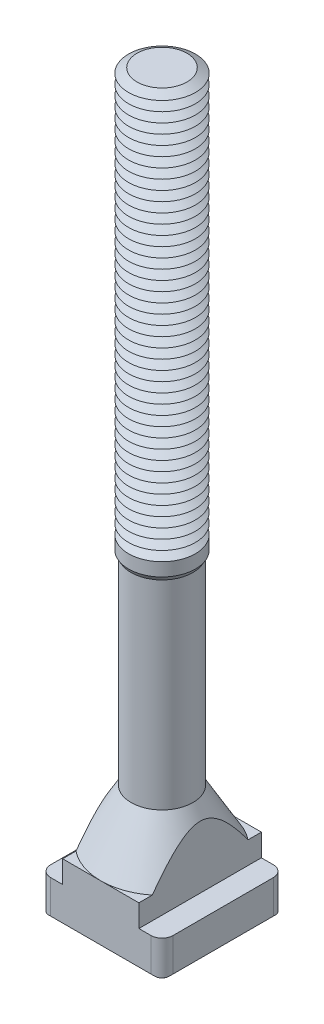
ISO-10303-21;
HEADER;
FILE_DESCRIPTION(('STEP AP214'),'2;1');
FILE_NAME('part.step','',(''),(''),'','','');
FILE_SCHEMA(('AUTOMOTIVE_DESIGN { 1 0 10303 214 1 1 1 1 }'));
ENDSEC;
DATA;
#1=APPLICATION_CONTEXT('core data for automotive mechanical design processes');
#2=APPLICATION_PROTOCOL_DEFINITION('international standard','automotive_design',2000,#1);
#3=PRODUCT_CONTEXT('',#1,'mechanical');
#4=PRODUCT('Part','Part','',(#3));
#5=PRODUCT_RELATED_PRODUCT_CATEGORY('part','',(#4));
#6=PRODUCT_DEFINITION_FORMATION('','',#4);
#7=PRODUCT_DEFINITION_CONTEXT('part definition',#1,'design');
#8=PRODUCT_DEFINITION('design','',#6,#7);
#9=PRODUCT_DEFINITION_SHAPE('','',#8);
#10=(LENGTH_UNIT() NAMED_UNIT(*) SI_UNIT(.MILLI.,.METRE.));
#11=(NAMED_UNIT(*) PLANE_ANGLE_UNIT() SI_UNIT($,.RADIAN.));
#12=(NAMED_UNIT(*) SI_UNIT($,.STERADIAN.) SOLID_ANGLE_UNIT());
#13=UNCERTAINTY_MEASURE_WITH_UNIT(LENGTH_MEASURE(1.E-05),#10,'distance_accuracy_value','');
#14=(GEOMETRIC_REPRESENTATION_CONTEXT(3) GLOBAL_UNCERTAINTY_ASSIGNED_CONTEXT((#13)) GLOBAL_UNIT_ASSIGNED_CONTEXT((#10,
#11,#12)) REPRESENTATION_CONTEXT('',''));
#15=CARTESIAN_POINT('',(0.,0.,0.));
#16=DIRECTION('',(0.,0.,1.));
#17=DIRECTION('',(1.,0.,0.));
#18=AXIS2_PLACEMENT_3D('',#15,#16,#17);
#19=CARTESIAN_POINT('',(0.,126.,0.));
#20=DIRECTION('',(0.,-1.,0.));
#21=DIRECTION('',(0.,0.,-1.));
#22=AXIS2_PLACEMENT_3D('',#19,#20,#21);
#23=CONICAL_SURFACE('',#22,4.48445554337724,1.04719755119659);
#24=CARTESIAN_POINT('',(0.,125.125,0.));
#25=DIRECTION('',(0.,-1.,0.));
#26=DIRECTION('',(0.,0.,-1.));
#27=AXIS2_PLACEMENT_3D('',#24,#25,#26);
#28=CIRCLE('',#27,6.);
#29=CARTESIAN_POINT('',(0.,125.125,-6.));
#30=VERTEX_POINT('',#29);
#31=EDGE_CURVE('E707',#30,#30,#28,.T.);
#32=ORIENTED_EDGE('',*,*,#31,.F.);
#33=EDGE_LOOP('',(#32));
#34=FACE_BOUND('',#33,.T.);
#35=CARTESIAN_POINT('',(0.,126.,0.));
#36=DIRECTION('',(0.,-1.,0.));
#37=DIRECTION('',(0.,0.,-1.));
#38=AXIS2_PLACEMENT_3D('',#35,#36,#37);
#39=CIRCLE('',#38,4.48445554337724);
#40=CARTESIAN_POINT('',(0.,126.,-4.48445554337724));
#41=VERTEX_POINT('',#40);
#42=EDGE_CURVE('E786',#41,#41,#39,.T.);
#43=ORIENTED_EDGE('',*,*,#42,.T.);
#44=EDGE_LOOP('',(#43));
#45=FACE_BOUND('',#44,.T.);
#46=ADVANCED_FACE('F39',(#34,#45),#23,.T.);
#47=CARTESIAN_POINT('',(0.,126.875,0.));
#48=DIRECTION('',(0.,1.,0.));
#49=DIRECTION('',(0.,0.,1.));
#50=AXIS2_PLACEMENT_3D('',#47,#48,#49);
#51=CONICAL_SURFACE('',#50,6.,1.04719755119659);
#52=ORIENTED_EDGE('',*,*,#42,.F.);
#53=EDGE_LOOP('',(#52));
#54=FACE_BOUND('',#53,.T.);
#55=CARTESIAN_POINT('',(0.,126.875,0.));
#56=DIRECTION('',(0.,-1.,0.));
#57=DIRECTION('',(0.,0.,-1.));
#58=AXIS2_PLACEMENT_3D('',#55,#56,#57);
#59=CIRCLE('',#58,6.);
#60=CARTESIAN_POINT('',(0.,126.875,-6.));
#61=VERTEX_POINT('',#60);
#62=EDGE_CURVE('E789',#61,#61,#59,.T.);
#63=ORIENTED_EDGE('',*,*,#62,.T.);
#64=EDGE_LOOP('',(#63));
#65=FACE_BOUND('',#64,.T.);
#66=ADVANCED_FACE('F449',(#54,#65),#51,.T.);
#67=CARTESIAN_POINT('',(2.99954748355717,133.,0.));
#68=DIRECTION('',(0.,-1.,0.));
#69=DIRECTION('',(1.,0.,0.));
#70=AXIS2_PLACEMENT_3D('',#67,#68,#69);
#71=PLANE('',#70);
#72=CARTESIAN_POINT('',(0.,133.,0.));
#73=DIRECTION('',(0.,-1.,0.));
#74=DIRECTION('',(0.,0.,-1.));
#75=AXIS2_PLACEMENT_3D('',#72,#73,#74);
#76=CIRCLE('',#75,4.48445554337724);
#77=CARTESIAN_POINT('',(0.,133.,-4.48445554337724));
#78=VERTEX_POINT('',#77);
#79=EDGE_CURVE('E766',#78,#78,#76,.T.);
#80=ORIENTED_EDGE('',*,*,#79,.F.);
#81=EDGE_LOOP('',(#80));
#82=FACE_BOUND('',#81,.T.);
#83=ADVANCED_FACE('F455',(#82),#71,.F.);
#84=CARTESIAN_POINT('',(0.,133.,0.));
#85=DIRECTION('',(0.,-1.,0.));
#86=DIRECTION('',(0.,0.,-1.));
#87=AXIS2_PLACEMENT_3D('',#84,#85,#86);
#88=CONICAL_SURFACE('',#87,4.48445554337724,1.04719755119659);
#89=CARTESIAN_POINT('',(0.,132.125,0.));
#90=DIRECTION('',(0.,-1.,0.));
#91=DIRECTION('',(0.,0.,-1.));
#92=AXIS2_PLACEMENT_3D('',#89,#90,#91);
#93=CIRCLE('',#92,6.);
#94=CARTESIAN_POINT('',(0.,132.125,-6.));
#95=VERTEX_POINT('',#94);
#96=EDGE_CURVE('E632',#95,#95,#93,.T.);
#97=ORIENTED_EDGE('',*,*,#96,.F.);
#98=EDGE_LOOP('',(#97));
#99=FACE_BOUND('',#98,.T.);
#100=ORIENTED_EDGE('',*,*,#79,.T.);
#101=EDGE_LOOP('',(#100));
#102=FACE_BOUND('',#101,.T.);
#103=ADVANCED_FACE('F483',(#99,#102),#88,.T.);
#104=CARTESIAN_POINT('',(0.,132.125,0.));
#105=DIRECTION('',(0.,1.,0.));
#106=DIRECTION('',(0.,0.,1.));
#107=AXIS2_PLACEMENT_3D('',#104,#105,#106);
#108=CONICAL_SURFACE('',#107,6.,1.04719755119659);
#109=CARTESIAN_POINT('',(0.,131.25,0.));
#110=DIRECTION('',(0.,-1.,0.));
#111=DIRECTION('',(0.,0.,-1.));
#112=AXIS2_PLACEMENT_3D('',#109,#110,#111);
#113=CIRCLE('',#112,4.48445554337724);
#114=CARTESIAN_POINT('',(0.,131.25,-4.48445554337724));
#115=VERTEX_POINT('',#114);
#116=EDGE_CURVE('E674',#115,#115,#113,.T.);
#117=ORIENTED_EDGE('',*,*,#116,.F.);
#118=EDGE_LOOP('',(#117));
#119=FACE_BOUND('',#118,.T.);
#120=ORIENTED_EDGE('',*,*,#96,.T.);
#121=EDGE_LOOP('',(#120));
#122=FACE_BOUND('',#121,.T.);
#123=ADVANCED_FACE('F480',(#119,#122),#108,.T.);
#124=CARTESIAN_POINT('',(0.,131.25,0.));
#125=DIRECTION('',(0.,-1.,0.));
#126=DIRECTION('',(0.,0.,-1.));
#127=AXIS2_PLACEMENT_3D('',#124,#125,#126);
#128=CONICAL_SURFACE('',#127,4.48445554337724,1.04719755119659);
#129=CARTESIAN_POINT('',(0.,130.375,0.));
#130=DIRECTION('',(0.,-1.,0.));
#131=DIRECTION('',(0.,0.,-1.));
#132=AXIS2_PLACEMENT_3D('',#129,#130,#131);
#133=CIRCLE('',#132,6.);
#134=CARTESIAN_POINT('',(0.,130.375,-6.));
#135=VERTEX_POINT('',#134);
#136=EDGE_CURVE('E676',#135,#135,#133,.T.);
#137=ORIENTED_EDGE('',*,*,#136,.F.);
#138=EDGE_LOOP('',(#137));
#139=FACE_BOUND('',#138,.T.);
#140=ORIENTED_EDGE('',*,*,#116,.T.);
#141=EDGE_LOOP('',(#140));
#142=FACE_BOUND('',#141,.T.);
#143=ADVANCED_FACE('F475',(#139,#142),#128,.T.);
#144=CARTESIAN_POINT('',(0.,130.375,0.));
#145=DIRECTION('',(0.,1.,0.));
#146=DIRECTION('',(0.,0.,1.));
#147=AXIS2_PLACEMENT_3D('',#144,#145,#146);
#148=CONICAL_SURFACE('',#147,6.,1.04719755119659);
#149=CARTESIAN_POINT('',(0.,129.5,0.));
#150=DIRECTION('',(0.,-1.,0.));
#151=DIRECTION('',(0.,0.,-1.));
#152=AXIS2_PLACEMENT_3D('',#149,#150,#151);
#153=CIRCLE('',#152,4.48445554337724);
#154=CARTESIAN_POINT('',(0.,129.5,-4.48445554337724));
#155=VERTEX_POINT('',#154);
#156=EDGE_CURVE('E671',#155,#155,#153,.T.);
#157=ORIENTED_EDGE('',*,*,#156,.F.);
#158=EDGE_LOOP('',(#157));
#159=FACE_BOUND('',#158,.T.);
#160=ORIENTED_EDGE('',*,*,#136,.T.);
#161=EDGE_LOOP('',(#160));
#162=FACE_BOUND('',#161,.T.);
#163=ADVANCED_FACE('F472',(#159,#162),#148,.T.);
#164=CARTESIAN_POINT('',(0.,129.5,0.));
#165=DIRECTION('',(0.,-1.,0.));
#166=DIRECTION('',(0.,0.,-1.));
#167=AXIS2_PLACEMENT_3D('',#164,#165,#166);
#168=CONICAL_SURFACE('',#167,4.48445554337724,1.04719755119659);
#169=CARTESIAN_POINT('',(0.,128.625,0.));
#170=DIRECTION('',(0.,-1.,0.));
#171=DIRECTION('',(0.,0.,-1.));
#172=AXIS2_PLACEMENT_3D('',#169,#170,#171);
#173=CIRCLE('',#172,6.);
#174=CARTESIAN_POINT('',(0.,128.625,-6.));
#175=VERTEX_POINT('',#174);
#176=EDGE_CURVE('E668',#175,#175,#173,.T.);
#177=ORIENTED_EDGE('',*,*,#176,.F.);
#178=EDGE_LOOP('',(#177));
#179=FACE_BOUND('',#178,.T.);
#180=ORIENTED_EDGE('',*,*,#156,.T.);
#181=EDGE_LOOP('',(#180));
#182=FACE_BOUND('',#181,.T.);
#183=ADVANCED_FACE('F466',(#179,#182),#168,.T.);
#184=CARTESIAN_POINT('',(0.,128.625,0.));
#185=DIRECTION('',(0.,1.,0.));
#186=DIRECTION('',(0.,0.,1.));
#187=AXIS2_PLACEMENT_3D('',#184,#185,#186);
#188=CONICAL_SURFACE('',#187,6.,1.04719755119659);
#189=CARTESIAN_POINT('',(0.,127.75,0.));
#190=DIRECTION('',(0.,-1.,0.));
#191=DIRECTION('',(0.,0.,-1.));
#192=AXIS2_PLACEMENT_3D('',#189,#190,#191);
#193=CIRCLE('',#192,4.48445554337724);
#194=CARTESIAN_POINT('',(0.,127.75,-4.48445554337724));
#195=VERTEX_POINT('',#194);
#196=EDGE_CURVE('E672',#195,#195,#193,.T.);
#197=ORIENTED_EDGE('',*,*,#196,.F.);
#198=EDGE_LOOP('',(#197));
#199=FACE_BOUND('',#198,.T.);
#200=ORIENTED_EDGE('',*,*,#176,.T.);
#201=EDGE_LOOP('',(#200));
#202=FACE_BOUND('',#201,.T.);
#203=ADVANCED_FACE('F462',(#199,#202),#188,.T.);
#204=CARTESIAN_POINT('',(0.,127.75,0.));
#205=DIRECTION('',(0.,-1.,0.));
#206=DIRECTION('',(0.,0.,-1.));
#207=AXIS2_PLACEMENT_3D('',#204,#205,#206);
#208=CONICAL_SURFACE('',#207,4.48445554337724,1.04719755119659);
#209=ORIENTED_EDGE('',*,*,#62,.F.);
#210=EDGE_LOOP('',(#209));
#211=FACE_BOUND('',#210,.T.);
#212=ORIENTED_EDGE('',*,*,#196,.T.);
#213=EDGE_LOOP('',(#212));
#214=FACE_BOUND('',#213,.T.);
#215=ADVANCED_FACE('F465',(#211,#214),#208,.T.);
#216=CARTESIAN_POINT('',(0.,124.25,0.));
#217=DIRECTION('',(0.,-1.,0.));
#218=DIRECTION('',(0.,0.,-1.));
#219=AXIS2_PLACEMENT_3D('',#216,#217,#218);
#220=CONICAL_SURFACE('',#219,4.48445554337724,1.04719755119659);
#221=CARTESIAN_POINT('',(0.,123.375,0.));
#222=DIRECTION('',(0.,-1.,0.));
#223=DIRECTION('',(0.,0.,-1.));
#224=AXIS2_PLACEMENT_3D('',#221,#222,#223);
#225=CIRCLE('',#224,6.);
#226=CARTESIAN_POINT('',(0.,123.375,-6.));
#227=VERTEX_POINT('',#226);
#228=EDGE_CURVE('E708',#227,#227,#225,.T.);
#229=ORIENTED_EDGE('',*,*,#228,.F.);
#230=EDGE_LOOP('',(#229));
#231=FACE_BOUND('',#230,.T.);
#232=CARTESIAN_POINT('',(0.,124.25,0.));
#233=DIRECTION('',(0.,-1.,0.));
#234=DIRECTION('',(0.,0.,-1.));
#235=AXIS2_PLACEMENT_3D('',#232,#233,#234);
#236=CIRCLE('',#235,4.48445554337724);
#237=CARTESIAN_POINT('',(0.,124.25,-4.48445554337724));
#238=VERTEX_POINT('',#237);
#239=EDGE_CURVE('E705',#238,#238,#236,.T.);
#240=ORIENTED_EDGE('',*,*,#239,.T.);
#241=EDGE_LOOP('',(#240));
#242=FACE_BOUND('',#241,.T.);
#243=ADVANCED_FACE('F470',(#231,#242),#220,.T.);
#244=CARTESIAN_POINT('',(0.,125.125,0.));
#245=DIRECTION('',(0.,1.,0.));
#246=DIRECTION('',(0.,0.,1.));
#247=AXIS2_PLACEMENT_3D('',#244,#245,#246);
#248=CONICAL_SURFACE('',#247,6.,1.04719755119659);
#249=ORIENTED_EDGE('',*,*,#239,.F.);
#250=EDGE_LOOP('',(#249));
#251=FACE_BOUND('',#250,.T.);
#252=ORIENTED_EDGE('',*,*,#31,.T.);
#253=EDGE_LOOP('',(#252));
#254=FACE_BOUND('',#253,.T.);
#255=ADVANCED_FACE('F921',(#251,#254),#248,.T.);
#256=CARTESIAN_POINT('',(0.,122.5,0.));
#257=DIRECTION('',(0.,-1.,0.));
#258=DIRECTION('',(0.,0.,-1.));
#259=AXIS2_PLACEMENT_3D('',#256,#257,#258);
#260=CONICAL_SURFACE('',#259,4.48445554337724,1.04719755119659);
#261=CARTESIAN_POINT('',(0.,121.625,0.));
#262=DIRECTION('',(0.,-1.,0.));
#263=DIRECTION('',(0.,0.,-1.));
#264=AXIS2_PLACEMENT_3D('',#261,#262,#263);
#265=CIRCLE('',#264,6.);
#266=CARTESIAN_POINT('',(0.,121.625,-6.));
#267=VERTEX_POINT('',#266);
#268=EDGE_CURVE('E732',#267,#267,#265,.T.);
#269=ORIENTED_EDGE('',*,*,#268,.F.);
#270=EDGE_LOOP('',(#269));
#271=FACE_BOUND('',#270,.T.);
#272=CARTESIAN_POINT('',(0.,122.5,0.));
#273=DIRECTION('',(0.,-1.,0.));
#274=DIRECTION('',(0.,0.,-1.));
#275=AXIS2_PLACEMENT_3D('',#272,#273,#274);
#276=CIRCLE('',#275,4.48445554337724);
#277=CARTESIAN_POINT('',(0.,122.5,-4.48445554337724));
#278=VERTEX_POINT('',#277);
#279=EDGE_CURVE('E764',#278,#278,#276,.T.);
#280=ORIENTED_EDGE('',*,*,#279,.T.);
#281=EDGE_LOOP('',(#280));
#282=FACE_BOUND('',#281,.T.);
#283=ADVANCED_FACE('F923',(#271,#282),#260,.T.);
#284=CARTESIAN_POINT('',(0.,123.375,0.));
#285=DIRECTION('',(0.,1.,0.));
#286=DIRECTION('',(0.,0.,1.));
#287=AXIS2_PLACEMENT_3D('',#284,#285,#286);
#288=CONICAL_SURFACE('',#287,6.,1.04719755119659);
#289=ORIENTED_EDGE('',*,*,#279,.F.);
#290=EDGE_LOOP('',(#289));
#291=FACE_BOUND('',#290,.T.);
#292=ORIENTED_EDGE('',*,*,#228,.T.);
#293=EDGE_LOOP('',(#292));
#294=FACE_BOUND('',#293,.T.);
#295=ADVANCED_FACE('F930',(#291,#294),#288,.T.);
#296=CARTESIAN_POINT('',(0.,120.75,0.));
#297=DIRECTION('',(0.,-1.,0.));
#298=DIRECTION('',(0.,0.,-1.));
#299=AXIS2_PLACEMENT_3D('',#296,#297,#298);
#300=CONICAL_SURFACE('',#299,4.48445554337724,1.04719755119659);
#301=CARTESIAN_POINT('',(0.,119.875,0.));
#302=DIRECTION('',(0.,-1.,0.));
#303=DIRECTION('',(0.,0.,-1.));
#304=AXIS2_PLACEMENT_3D('',#301,#302,#303);
#305=CIRCLE('',#304,6.);
#306=CARTESIAN_POINT('',(0.,119.875,-6.));
#307=VERTEX_POINT('',#306);
#308=EDGE_CURVE('E733',#307,#307,#305,.T.);
#309=ORIENTED_EDGE('',*,*,#308,.F.);
#310=EDGE_LOOP('',(#309));
#311=FACE_BOUND('',#310,.T.);
#312=CARTESIAN_POINT('',(0.,120.75,0.));
#313=DIRECTION('',(0.,-1.,0.));
#314=DIRECTION('',(0.,0.,-1.));
#315=AXIS2_PLACEMENT_3D('',#312,#313,#314);
#316=CIRCLE('',#315,4.48445554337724);
#317=CARTESIAN_POINT('',(0.,120.75,-4.48445554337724));
#318=VERTEX_POINT('',#317);
#319=EDGE_CURVE('E730',#318,#318,#316,.T.);
#320=ORIENTED_EDGE('',*,*,#319,.T.);
#321=EDGE_LOOP('',(#320));
#322=FACE_BOUND('',#321,.T.);
#323=ADVANCED_FACE('F938',(#311,#322),#300,.T.);
#324=CARTESIAN_POINT('',(0.,121.625,0.));
#325=DIRECTION('',(0.,1.,0.));
#326=DIRECTION('',(0.,0.,1.));
#327=AXIS2_PLACEMENT_3D('',#324,#325,#326);
#328=CONICAL_SURFACE('',#327,6.,1.04719755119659);
#329=ORIENTED_EDGE('',*,*,#319,.F.);
#330=EDGE_LOOP('',(#329));
#331=FACE_BOUND('',#330,.T.);
#332=ORIENTED_EDGE('',*,*,#268,.T.);
#333=EDGE_LOOP('',(#332));
#334=FACE_BOUND('',#333,.T.);
#335=ADVANCED_FACE('F942',(#331,#334),#328,.T.);
#336=CARTESIAN_POINT('',(0.,119.,0.));
#337=DIRECTION('',(0.,-1.,0.));
#338=DIRECTION('',(0.,0.,-1.));
#339=AXIS2_PLACEMENT_3D('',#336,#337,#338);
#340=CONICAL_SURFACE('',#339,4.48445554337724,1.04719755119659);
#341=CARTESIAN_POINT('',(0.,118.125,0.));
#342=DIRECTION('',(0.,-1.,0.));
#343=DIRECTION('',(0.,0.,-1.));
#344=AXIS2_PLACEMENT_3D('',#341,#342,#343);
#345=CIRCLE('',#344,6.);
#346=CARTESIAN_POINT('',(0.,118.125,-6.));
#347=VERTEX_POINT('',#346);
#348=EDGE_CURVE('E662',#347,#347,#345,.T.);
#349=ORIENTED_EDGE('',*,*,#348,.F.);
#350=EDGE_LOOP('',(#349));
#351=FACE_BOUND('',#350,.T.);
#352=CARTESIAN_POINT('',(0.,119.,0.));
#353=DIRECTION('',(0.,-1.,0.));
#354=DIRECTION('',(0.,0.,-1.));
#355=AXIS2_PLACEMENT_3D('',#352,#353,#354);
#356=CIRCLE('',#355,4.48445554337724);
#357=CARTESIAN_POINT('',(0.,119.,-4.48445554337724));
#358=VERTEX_POINT('',#357);
#359=EDGE_CURVE('E665',#358,#358,#356,.T.);
#360=ORIENTED_EDGE('',*,*,#359,.T.);
#361=EDGE_LOOP('',(#360));
#362=FACE_BOUND('',#361,.T.);
#363=ADVANCED_FACE('F946',(#351,#362),#340,.T.);
#364=CARTESIAN_POINT('',(0.,119.875,0.));
#365=DIRECTION('',(0.,1.,0.));
#366=DIRECTION('',(0.,0.,1.));
#367=AXIS2_PLACEMENT_3D('',#364,#365,#366);
#368=CONICAL_SURFACE('',#367,6.,1.04719755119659);
#369=ORIENTED_EDGE('',*,*,#359,.F.);
#370=EDGE_LOOP('',(#369));
#371=FACE_BOUND('',#370,.T.);
#372=ORIENTED_EDGE('',*,*,#308,.T.);
#373=EDGE_LOOP('',(#372));
#374=FACE_BOUND('',#373,.T.);
#375=ADVANCED_FACE('F950',(#371,#374),#368,.T.);
#376=CARTESIAN_POINT('',(0.,117.25,0.));
#377=DIRECTION('',(0.,-1.,0.));
#378=DIRECTION('',(0.,0.,-1.));
#379=AXIS2_PLACEMENT_3D('',#376,#377,#378);
#380=CONICAL_SURFACE('',#379,4.48445554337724,1.04719755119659);
#381=CARTESIAN_POINT('',(0.,116.375,0.));
#382=DIRECTION('',(0.,-1.,0.));
#383=DIRECTION('',(0.,0.,-1.));
#384=AXIS2_PLACEMENT_3D('',#381,#382,#383);
#385=CIRCLE('',#384,6.);
#386=CARTESIAN_POINT('',(0.,116.375,-6.));
#387=VERTEX_POINT('',#386);
#388=EDGE_CURVE('E760',#387,#387,#385,.T.);
#389=ORIENTED_EDGE('',*,*,#388,.F.);
#390=EDGE_LOOP('',(#389));
#391=FACE_BOUND('',#390,.T.);
#392=CARTESIAN_POINT('',(0.,117.25,0.));
#393=DIRECTION('',(0.,-1.,0.));
#394=DIRECTION('',(0.,0.,-1.));
#395=AXIS2_PLACEMENT_3D('',#392,#393,#394);
#396=CIRCLE('',#395,4.48445554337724);
#397=CARTESIAN_POINT('',(0.,117.25,-4.48445554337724));
#398=VERTEX_POINT('',#397);
#399=EDGE_CURVE('E666',#398,#398,#396,.T.);
#400=ORIENTED_EDGE('',*,*,#399,.T.);
#401=EDGE_LOOP('',(#400));
#402=FACE_BOUND('',#401,.T.);
#403=ADVANCED_FACE('F954',(#391,#402),#380,.T.);
#404=CARTESIAN_POINT('',(0.,118.125,0.));
#405=DIRECTION('',(0.,1.,0.));
#406=DIRECTION('',(0.,0.,1.));
#407=AXIS2_PLACEMENT_3D('',#404,#405,#406);
#408=CONICAL_SURFACE('',#407,6.,1.04719755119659);
#409=ORIENTED_EDGE('',*,*,#399,.F.);
#410=EDGE_LOOP('',(#409));
#411=FACE_BOUND('',#410,.T.);
#412=ORIENTED_EDGE('',*,*,#348,.T.);
#413=EDGE_LOOP('',(#412));
#414=FACE_BOUND('',#413,.T.);
#415=ADVANCED_FACE('F958',(#411,#414),#408,.T.);
#416=CARTESIAN_POINT('',(0.,115.5,0.));
#417=DIRECTION('',(0.,-1.,0.));
#418=DIRECTION('',(0.,0.,-1.));
#419=AXIS2_PLACEMENT_3D('',#416,#417,#418);
#420=CONICAL_SURFACE('',#419,4.48445554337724,1.04719755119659);
#421=CARTESIAN_POINT('',(0.,114.625,0.));
#422=DIRECTION('',(0.,-1.,0.));
#423=DIRECTION('',(0.,0.,-1.));
#424=AXIS2_PLACEMENT_3D('',#421,#422,#423);
#425=CIRCLE('',#424,6.);
#426=CARTESIAN_POINT('',(0.,114.625,-6.));
#427=VERTEX_POINT('',#426);
#428=EDGE_CURVE('E808',#427,#427,#425,.T.);
#429=ORIENTED_EDGE('',*,*,#428,.F.);
#430=EDGE_LOOP('',(#429));
#431=FACE_BOUND('',#430,.T.);
#432=CARTESIAN_POINT('',(0.,115.5,0.));
#433=DIRECTION('',(0.,-1.,0.));
#434=DIRECTION('',(0.,0.,-1.));
#435=AXIS2_PLACEMENT_3D('',#432,#433,#434);
#436=CIRCLE('',#435,4.48445554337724);
#437=CARTESIAN_POINT('',(0.,115.5,-4.48445554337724));
#438=VERTEX_POINT('',#437);
#439=EDGE_CURVE('E810',#438,#438,#436,.T.);
#440=ORIENTED_EDGE('',*,*,#439,.T.);
#441=EDGE_LOOP('',(#440));
#442=FACE_BOUND('',#441,.T.);
#443=ADVANCED_FACE('F962',(#431,#442),#420,.T.);
#444=CARTESIAN_POINT('',(0.,116.375,0.));
#445=DIRECTION('',(0.,1.,0.));
#446=DIRECTION('',(0.,0.,1.));
#447=AXIS2_PLACEMENT_3D('',#444,#445,#446);
#448=CONICAL_SURFACE('',#447,6.,1.04719755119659);
#449=ORIENTED_EDGE('',*,*,#439,.F.);
#450=EDGE_LOOP('',(#449));
#451=FACE_BOUND('',#450,.T.);
#452=ORIENTED_EDGE('',*,*,#388,.T.);
#453=EDGE_LOOP('',(#452));
#454=FACE_BOUND('',#453,.T.);
#455=ADVANCED_FACE('F966',(#451,#454),#448,.T.);
#456=CARTESIAN_POINT('',(0.,113.75,0.));
#457=DIRECTION('',(0.,-1.,0.));
#458=DIRECTION('',(0.,0.,-1.));
#459=AXIS2_PLACEMENT_3D('',#456,#457,#458);
#460=CONICAL_SURFACE('',#459,4.48445554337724,1.04719755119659);
#461=CARTESIAN_POINT('',(0.,112.875,0.));
#462=DIRECTION('',(0.,-1.,0.));
#463=DIRECTION('',(0.,0.,-1.));
#464=AXIS2_PLACEMENT_3D('',#461,#462,#463);
#465=CIRCLE('',#464,6.);
#466=CARTESIAN_POINT('',(0.,112.875,-6.));
#467=VERTEX_POINT('',#466);
#468=EDGE_CURVE('E900',#467,#467,#465,.T.);
#469=ORIENTED_EDGE('',*,*,#468,.F.);
#470=EDGE_LOOP('',(#469));
#471=FACE_BOUND('',#470,.T.);
#472=CARTESIAN_POINT('',(0.,113.75,0.));
#473=DIRECTION('',(0.,-1.,0.));
#474=DIRECTION('',(0.,0.,-1.));
#475=AXIS2_PLACEMENT_3D('',#472,#473,#474);
#476=CIRCLE('',#475,4.48445554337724);
#477=CARTESIAN_POINT('',(0.,113.75,-4.48445554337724));
#478=VERTEX_POINT('',#477);
#479=EDGE_CURVE('E811',#478,#478,#476,.T.);
#480=ORIENTED_EDGE('',*,*,#479,.T.);
#481=EDGE_LOOP('',(#480));
#482=FACE_BOUND('',#481,.T.);
#483=ADVANCED_FACE('F970',(#471,#482),#460,.T.);
#484=CARTESIAN_POINT('',(0.,114.625,0.));
#485=DIRECTION('',(0.,1.,0.));
#486=DIRECTION('',(0.,0.,1.));
#487=AXIS2_PLACEMENT_3D('',#484,#485,#486);
#488=CONICAL_SURFACE('',#487,6.,1.04719755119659);
#489=ORIENTED_EDGE('',*,*,#479,.F.);
#490=EDGE_LOOP('',(#489));
#491=FACE_BOUND('',#490,.T.);
#492=ORIENTED_EDGE('',*,*,#428,.T.);
#493=EDGE_LOOP('',(#492));
#494=FACE_BOUND('',#493,.T.);
#495=ADVANCED_FACE('F974',(#491,#494),#488,.T.);
#496=CARTESIAN_POINT('',(0.,112.,0.));
#497=DIRECTION('',(0.,-1.,0.));
#498=DIRECTION('',(0.,0.,-1.));
#499=AXIS2_PLACEMENT_3D('',#496,#497,#498);
#500=CONICAL_SURFACE('',#499,4.48445554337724,1.04719755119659);
#501=CARTESIAN_POINT('',(0.,111.125,0.));
#502=DIRECTION('',(0.,-1.,0.));
#503=DIRECTION('',(0.,0.,-1.));
#504=AXIS2_PLACEMENT_3D('',#501,#502,#503);
#505=CIRCLE('',#504,6.);
#506=CARTESIAN_POINT('',(0.,111.125,-6.));
#507=VERTEX_POINT('',#506);
#508=EDGE_CURVE('E655',#507,#507,#505,.T.);
#509=ORIENTED_EDGE('',*,*,#508,.F.);
#510=EDGE_LOOP('',(#509));
#511=FACE_BOUND('',#510,.T.);
#512=CARTESIAN_POINT('',(0.,112.,0.));
#513=DIRECTION('',(0.,-1.,0.));
#514=DIRECTION('',(0.,0.,-1.));
#515=AXIS2_PLACEMENT_3D('',#512,#513,#514);
#516=CIRCLE('',#515,4.48445554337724);
#517=CARTESIAN_POINT('',(0.,112.,-4.48445554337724));
#518=VERTEX_POINT('',#517);
#519=EDGE_CURVE('E660',#518,#518,#516,.T.);
#520=ORIENTED_EDGE('',*,*,#519,.T.);
#521=EDGE_LOOP('',(#520));
#522=FACE_BOUND('',#521,.T.);
#523=ADVANCED_FACE('F978',(#511,#522),#500,.T.);
#524=CARTESIAN_POINT('',(0.,112.875,0.));
#525=DIRECTION('',(0.,1.,0.));
#526=DIRECTION('',(0.,0.,1.));
#527=AXIS2_PLACEMENT_3D('',#524,#525,#526);
#528=CONICAL_SURFACE('',#527,6.,1.04719755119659);
#529=ORIENTED_EDGE('',*,*,#519,.F.);
#530=EDGE_LOOP('',(#529));
#531=FACE_BOUND('',#530,.T.);
#532=ORIENTED_EDGE('',*,*,#468,.T.);
#533=EDGE_LOOP('',(#532));
#534=FACE_BOUND('',#533,.T.);
#535=ADVANCED_FACE('F982',(#531,#534),#528,.T.);
#536=CARTESIAN_POINT('',(0.,110.25,0.));
#537=DIRECTION('',(0.,-1.,0.));
#538=DIRECTION('',(0.,0.,-1.));
#539=AXIS2_PLACEMENT_3D('',#536,#537,#538);
#540=CONICAL_SURFACE('',#539,4.48445554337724,1.04719755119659);
#541=CARTESIAN_POINT('',(0.,109.375,0.));
#542=DIRECTION('',(0.,-1.,0.));
#543=DIRECTION('',(0.,0.,-1.));
#544=AXIS2_PLACEMENT_3D('',#541,#542,#543);
#545=CIRCLE('',#544,6.);
#546=CARTESIAN_POINT('',(0.,109.375,-6.));
#547=VERTEX_POINT('',#546);
#548=EDGE_CURVE('E656',#547,#547,#545,.T.);
#549=ORIENTED_EDGE('',*,*,#548,.F.);
#550=EDGE_LOOP('',(#549));
#551=FACE_BOUND('',#550,.T.);
#552=CARTESIAN_POINT('',(0.,110.25,0.));
#553=DIRECTION('',(0.,-1.,0.));
#554=DIRECTION('',(0.,0.,-1.));
#555=AXIS2_PLACEMENT_3D('',#552,#553,#554);
#556=CIRCLE('',#555,4.48445554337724);
#557=CARTESIAN_POINT('',(0.,110.25,-4.48445554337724));
#558=VERTEX_POINT('',#557);
#559=EDGE_CURVE('E652',#558,#558,#556,.T.);
#560=ORIENTED_EDGE('',*,*,#559,.T.);
#561=EDGE_LOOP('',(#560));
#562=FACE_BOUND('',#561,.T.);
#563=ADVANCED_FACE('F986',(#551,#562),#540,.T.);
#564=CARTESIAN_POINT('',(0.,111.125,0.));
#565=DIRECTION('',(0.,1.,0.));
#566=DIRECTION('',(0.,0.,1.));
#567=AXIS2_PLACEMENT_3D('',#564,#565,#566);
#568=CONICAL_SURFACE('',#567,6.,1.04719755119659);
#569=ORIENTED_EDGE('',*,*,#559,.F.);
#570=EDGE_LOOP('',(#569));
#571=FACE_BOUND('',#570,.T.);
#572=ORIENTED_EDGE('',*,*,#508,.T.);
#573=EDGE_LOOP('',(#572));
#574=FACE_BOUND('',#573,.T.);
#575=ADVANCED_FACE('F990',(#571,#574),#568,.T.);
#576=CARTESIAN_POINT('',(0.,108.5,0.));
#577=DIRECTION('',(0.,-1.,0.));
#578=DIRECTION('',(0.,0.,-1.));
#579=AXIS2_PLACEMENT_3D('',#576,#577,#578);
#580=CONICAL_SURFACE('',#579,4.48445554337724,1.04719755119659);
#581=CARTESIAN_POINT('',(0.,107.625,0.));
#582=DIRECTION('',(0.,-1.,0.));
#583=DIRECTION('',(0.,0.,-1.));
#584=AXIS2_PLACEMENT_3D('',#581,#582,#583);
#585=CIRCLE('',#584,6.);
#586=CARTESIAN_POINT('',(0.,107.625,-6.));
#587=VERTEX_POINT('',#586);
#588=EDGE_CURVE('E649',#587,#587,#585,.T.);
#589=ORIENTED_EDGE('',*,*,#588,.F.);
#590=EDGE_LOOP('',(#589));
#591=FACE_BOUND('',#590,.T.);
#592=CARTESIAN_POINT('',(0.,108.5,0.));
#593=DIRECTION('',(0.,-1.,0.));
#594=DIRECTION('',(0.,0.,-1.));
#595=AXIS2_PLACEMENT_3D('',#592,#593,#594);
#596=CIRCLE('',#595,4.48445554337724);
#597=CARTESIAN_POINT('',(0.,108.5,-4.48445554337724));
#598=VERTEX_POINT('',#597);
#599=EDGE_CURVE('E840',#598,#598,#596,.T.);
#600=ORIENTED_EDGE('',*,*,#599,.T.);
#601=EDGE_LOOP('',(#600));
#602=FACE_BOUND('',#601,.T.);
#603=ADVANCED_FACE('F994',(#591,#602),#580,.T.);
#604=CARTESIAN_POINT('',(0.,109.375,0.));
#605=DIRECTION('',(0.,1.,0.));
#606=DIRECTION('',(0.,0.,1.));
#607=AXIS2_PLACEMENT_3D('',#604,#605,#606);
#608=CONICAL_SURFACE('',#607,6.,1.04719755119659);
#609=ORIENTED_EDGE('',*,*,#599,.F.);
#610=EDGE_LOOP('',(#609));
#611=FACE_BOUND('',#610,.T.);
#612=ORIENTED_EDGE('',*,*,#548,.T.);
#613=EDGE_LOOP('',(#612));
#614=FACE_BOUND('',#613,.T.);
#615=ADVANCED_FACE('F998',(#611,#614),#608,.T.);
#616=CARTESIAN_POINT('',(0.,106.75,0.));
#617=DIRECTION('',(0.,-1.,0.));
#618=DIRECTION('',(0.,0.,-1.));
#619=AXIS2_PLACEMENT_3D('',#616,#617,#618);
#620=CONICAL_SURFACE('',#619,4.48445554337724,1.04719755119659);
#621=CARTESIAN_POINT('',(0.,105.875,0.));
#622=DIRECTION('',(0.,-1.,0.));
#623=DIRECTION('',(0.,0.,-1.));
#624=AXIS2_PLACEMENT_3D('',#621,#622,#623);
#625=CIRCLE('',#624,6.);
#626=CARTESIAN_POINT('',(0.,105.875,-6.));
#627=VERTEX_POINT('',#626);
#628=EDGE_CURVE('E650',#627,#627,#625,.T.);
#629=ORIENTED_EDGE('',*,*,#628,.F.);
#630=EDGE_LOOP('',(#629));
#631=FACE_BOUND('',#630,.T.);
#632=CARTESIAN_POINT('',(0.,106.75,0.));
#633=DIRECTION('',(0.,-1.,0.));
#634=DIRECTION('',(0.,0.,-1.));
#635=AXIS2_PLACEMENT_3D('',#632,#633,#634);
#636=CIRCLE('',#635,4.48445554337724);
#637=CARTESIAN_POINT('',(0.,106.75,-4.48445554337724));
#638=VERTEX_POINT('',#637);
#639=EDGE_CURVE('E646',#638,#638,#636,.T.);
#640=ORIENTED_EDGE('',*,*,#639,.T.);
#641=EDGE_LOOP('',(#640));
#642=FACE_BOUND('',#641,.T.);
#643=ADVANCED_FACE('F1002',(#631,#642),#620,.T.);
#644=CARTESIAN_POINT('',(0.,107.625,0.));
#645=DIRECTION('',(0.,1.,0.));
#646=DIRECTION('',(0.,0.,1.));
#647=AXIS2_PLACEMENT_3D('',#644,#645,#646);
#648=CONICAL_SURFACE('',#647,6.,1.04719755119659);
#649=ORIENTED_EDGE('',*,*,#639,.F.);
#650=EDGE_LOOP('',(#649));
#651=FACE_BOUND('',#650,.T.);
#652=ORIENTED_EDGE('',*,*,#588,.T.);
#653=EDGE_LOOP('',(#652));
#654=FACE_BOUND('',#653,.T.);
#655=ADVANCED_FACE('F1006',(#651,#654),#648,.T.);
#656=CARTESIAN_POINT('',(0.,105.,0.));
#657=DIRECTION('',(0.,-1.,0.));
#658=DIRECTION('',(0.,0.,-1.));
#659=AXIS2_PLACEMENT_3D('',#656,#657,#658);
#660=CONICAL_SURFACE('',#659,4.48445554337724,1.04719755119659);
#661=CARTESIAN_POINT('',(0.,104.125,0.));
#662=DIRECTION('',(0.,-1.,0.));
#663=DIRECTION('',(0.,0.,-1.));
#664=AXIS2_PLACEMENT_3D('',#661,#662,#663);
#665=CIRCLE('',#664,6.);
#666=CARTESIAN_POINT('',(0.,104.125,-6.));
#667=VERTEX_POINT('',#666);
#668=EDGE_CURVE('E836',#667,#667,#665,.T.);
#669=ORIENTED_EDGE('',*,*,#668,.F.);
#670=EDGE_LOOP('',(#669));
#671=FACE_BOUND('',#670,.T.);
#672=CARTESIAN_POINT('',(0.,105.,0.));
#673=DIRECTION('',(0.,-1.,0.));
#674=DIRECTION('',(0.,0.,-1.));
#675=AXIS2_PLACEMENT_3D('',#672,#673,#674);
#676=CIRCLE('',#675,4.48445554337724);
#677=CARTESIAN_POINT('',(0.,105.,-4.48445554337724));
#678=VERTEX_POINT('',#677);
#679=EDGE_CURVE('E833',#678,#678,#676,.T.);
#680=ORIENTED_EDGE('',*,*,#679,.T.);
#681=EDGE_LOOP('',(#680));
#682=FACE_BOUND('',#681,.T.);
#683=ADVANCED_FACE('F1010',(#671,#682),#660,.T.);
#684=CARTESIAN_POINT('',(0.,105.875,0.));
#685=DIRECTION('',(0.,1.,0.));
#686=DIRECTION('',(0.,0.,1.));
#687=AXIS2_PLACEMENT_3D('',#684,#685,#686);
#688=CONICAL_SURFACE('',#687,6.,1.04719755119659);
#689=ORIENTED_EDGE('',*,*,#679,.F.);
#690=EDGE_LOOP('',(#689));
#691=FACE_BOUND('',#690,.T.);
#692=ORIENTED_EDGE('',*,*,#628,.T.);
#693=EDGE_LOOP('',(#692));
#694=FACE_BOUND('',#693,.T.);
#695=ADVANCED_FACE('F1014',(#691,#694),#688,.T.);
#696=CARTESIAN_POINT('',(0.,103.25,0.));
#697=DIRECTION('',(0.,-1.,0.));
#698=DIRECTION('',(0.,0.,-1.));
#699=AXIS2_PLACEMENT_3D('',#696,#697,#698);
#700=CONICAL_SURFACE('',#699,4.48445554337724,1.04719755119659);
#701=CARTESIAN_POINT('',(0.,102.375,0.));
#702=DIRECTION('',(0.,-1.,0.));
#703=DIRECTION('',(0.,0.,-1.));
#704=AXIS2_PLACEMENT_3D('',#701,#702,#703);
#705=CIRCLE('',#704,6.);
#706=CARTESIAN_POINT('',(0.,102.375,-6.));
#707=VERTEX_POINT('',#706);
#708=EDGE_CURVE('E828',#707,#707,#705,.T.);
#709=ORIENTED_EDGE('',*,*,#708,.F.);
#710=EDGE_LOOP('',(#709));
#711=FACE_BOUND('',#710,.T.);
#712=CARTESIAN_POINT('',(0.,103.25,0.));
#713=DIRECTION('',(0.,-1.,0.));
#714=DIRECTION('',(0.,0.,-1.));
#715=AXIS2_PLACEMENT_3D('',#712,#713,#714);
#716=CIRCLE('',#715,4.48445554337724);
#717=CARTESIAN_POINT('',(0.,103.25,-4.48445554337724));
#718=VERTEX_POINT('',#717);
#719=EDGE_CURVE('E831',#718,#718,#716,.T.);
#720=ORIENTED_EDGE('',*,*,#719,.T.);
#721=EDGE_LOOP('',(#720));
#722=FACE_BOUND('',#721,.T.);
#723=ADVANCED_FACE('F1018',(#711,#722),#700,.T.);
#724=CARTESIAN_POINT('',(0.,104.125,0.));
#725=DIRECTION('',(0.,1.,0.));
#726=DIRECTION('',(0.,0.,1.));
#727=AXIS2_PLACEMENT_3D('',#724,#725,#726);
#728=CONICAL_SURFACE('',#727,6.,1.04719755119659);
#729=ORIENTED_EDGE('',*,*,#719,.F.);
#730=EDGE_LOOP('',(#729));
#731=FACE_BOUND('',#730,.T.);
#732=ORIENTED_EDGE('',*,*,#668,.T.);
#733=EDGE_LOOP('',(#732));
#734=FACE_BOUND('',#733,.T.);
#735=ADVANCED_FACE('F1022',(#731,#734),#728,.T.);
#736=CARTESIAN_POINT('',(0.,101.5,0.));
#737=DIRECTION('',(0.,-1.,0.));
#738=DIRECTION('',(0.,0.,-1.));
#739=AXIS2_PLACEMENT_3D('',#736,#737,#738);
#740=CONICAL_SURFACE('',#739,4.48445554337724,1.04719755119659);
#741=CARTESIAN_POINT('',(0.,100.625,0.));
#742=DIRECTION('',(0.,-1.,0.));
#743=DIRECTION('',(0.,0.,-1.));
#744=AXIS2_PLACEMENT_3D('',#741,#742,#743);
#745=CIRCLE('',#744,6.);
#746=CARTESIAN_POINT('',(0.,100.625,-6.));
#747=VERTEX_POINT('',#746);
#748=EDGE_CURVE('E714',#747,#747,#745,.T.);
#749=ORIENTED_EDGE('',*,*,#748,.F.);
#750=EDGE_LOOP('',(#749));
#751=FACE_BOUND('',#750,.T.);
#752=CARTESIAN_POINT('',(0.,101.5,0.));
#753=DIRECTION('',(0.,-1.,0.));
#754=DIRECTION('',(0.,0.,-1.));
#755=AXIS2_PLACEMENT_3D('',#752,#753,#754);
#756=CIRCLE('',#755,4.48445554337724);
#757=CARTESIAN_POINT('',(0.,101.5,-4.48445554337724));
#758=VERTEX_POINT('',#757);
#759=EDGE_CURVE('E716',#758,#758,#756,.T.);
#760=ORIENTED_EDGE('',*,*,#759,.T.);
#761=EDGE_LOOP('',(#760));
#762=FACE_BOUND('',#761,.T.);
#763=ADVANCED_FACE('F1026',(#751,#762),#740,.T.);
#764=CARTESIAN_POINT('',(0.,102.375,0.));
#765=DIRECTION('',(0.,1.,0.));
#766=DIRECTION('',(0.,0.,1.));
#767=AXIS2_PLACEMENT_3D('',#764,#765,#766);
#768=CONICAL_SURFACE('',#767,6.,1.04719755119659);
#769=ORIENTED_EDGE('',*,*,#759,.F.);
#770=EDGE_LOOP('',(#769));
#771=FACE_BOUND('',#770,.T.);
#772=ORIENTED_EDGE('',*,*,#708,.T.);
#773=EDGE_LOOP('',(#772));
#774=FACE_BOUND('',#773,.T.);
#775=ADVANCED_FACE('F1030',(#771,#774),#768,.T.);
#776=CARTESIAN_POINT('',(0.,99.75,0.));
#777=DIRECTION('',(0.,-1.,0.));
#778=DIRECTION('',(0.,0.,-1.));
#779=AXIS2_PLACEMENT_3D('',#776,#777,#778);
#780=CONICAL_SURFACE('',#779,4.48445554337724,1.04719755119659);
#781=CARTESIAN_POINT('',(0.,98.875,0.));
#782=DIRECTION('',(0.,-1.,0.));
#783=DIRECTION('',(0.,0.,-1.));
#784=AXIS2_PLACEMENT_3D('',#781,#782,#783);
#785=CIRCLE('',#784,6.);
#786=CARTESIAN_POINT('',(0.,98.875,-6.));
#787=VERTEX_POINT('',#786);
#788=EDGE_CURVE('E1275',#787,#787,#785,.T.);
#789=ORIENTED_EDGE('',*,*,#788,.F.);
#790=EDGE_LOOP('',(#789));
#791=FACE_BOUND('',#790,.T.);
#792=CARTESIAN_POINT('',(0.,99.75,0.));
#793=DIRECTION('',(0.,-1.,0.));
#794=DIRECTION('',(0.,0.,-1.));
#795=AXIS2_PLACEMENT_3D('',#792,#793,#794);
#796=CIRCLE('',#795,4.48445554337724);
#797=CARTESIAN_POINT('',(0.,99.75,-4.48445554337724));
#798=VERTEX_POINT('',#797);
#799=EDGE_CURVE('E717',#798,#798,#796,.T.);
#800=ORIENTED_EDGE('',*,*,#799,.T.);
#801=EDGE_LOOP('',(#800));
#802=FACE_BOUND('',#801,.T.);
#803=ADVANCED_FACE('F1034',(#791,#802),#780,.T.);
#804=CARTESIAN_POINT('',(0.,100.625,0.));
#805=DIRECTION('',(0.,1.,0.));
#806=DIRECTION('',(0.,0.,1.));
#807=AXIS2_PLACEMENT_3D('',#804,#805,#806);
#808=CONICAL_SURFACE('',#807,6.,1.04719755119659);
#809=ORIENTED_EDGE('',*,*,#799,.F.);
#810=EDGE_LOOP('',(#809));
#811=FACE_BOUND('',#810,.T.);
#812=ORIENTED_EDGE('',*,*,#748,.T.);
#813=EDGE_LOOP('',(#812));
#814=FACE_BOUND('',#813,.T.);
#815=ADVANCED_FACE('F1038',(#811,#814),#808,.T.);
#816=CARTESIAN_POINT('',(0.,98.,0.));
#817=DIRECTION('',(0.,-1.,0.));
#818=DIRECTION('',(0.,0.,-1.));
#819=AXIS2_PLACEMENT_3D('',#816,#817,#818);
#820=CONICAL_SURFACE('',#819,4.48445554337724,1.04719755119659);
#821=CARTESIAN_POINT('',(0.,97.125,0.));
#822=DIRECTION('',(0.,-1.,0.));
#823=DIRECTION('',(0.,0.,-1.));
#824=AXIS2_PLACEMENT_3D('',#821,#822,#823);
#825=CIRCLE('',#824,6.);
#826=CARTESIAN_POINT('',(0.,97.125,-6.));
#827=VERTEX_POINT('',#826);
#828=EDGE_CURVE('E752',#827,#827,#825,.T.);
#829=ORIENTED_EDGE('',*,*,#828,.F.);
#830=EDGE_LOOP('',(#829));
#831=FACE_BOUND('',#830,.T.);
#832=CARTESIAN_POINT('',(0.,98.,0.));
#833=DIRECTION('',(0.,-1.,0.));
#834=DIRECTION('',(0.,0.,-1.));
#835=AXIS2_PLACEMENT_3D('',#832,#833,#834);
#836=CIRCLE('',#835,4.48445554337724);
#837=CARTESIAN_POINT('',(0.,98.,-4.48445554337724));
#838=VERTEX_POINT('',#837);
#839=EDGE_CURVE('E755',#838,#838,#836,.T.);
#840=ORIENTED_EDGE('',*,*,#839,.T.);
#841=EDGE_LOOP('',(#840));
#842=FACE_BOUND('',#841,.T.);
#843=ADVANCED_FACE('F1042',(#831,#842),#820,.T.);
#844=CARTESIAN_POINT('',(0.,98.875,0.));
#845=DIRECTION('',(0.,1.,0.));
#846=DIRECTION('',(0.,0.,1.));
#847=AXIS2_PLACEMENT_3D('',#844,#845,#846);
#848=CONICAL_SURFACE('',#847,6.,1.04719755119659);
#849=ORIENTED_EDGE('',*,*,#839,.F.);
#850=EDGE_LOOP('',(#849));
#851=FACE_BOUND('',#850,.T.);
#852=ORIENTED_EDGE('',*,*,#788,.T.);
#853=EDGE_LOOP('',(#852));
#854=FACE_BOUND('',#853,.T.);
#855=ADVANCED_FACE('F1046',(#851,#854),#848,.T.);
#856=CARTESIAN_POINT('',(0.,96.25,0.));
#857=DIRECTION('',(0.,-1.,0.));
#858=DIRECTION('',(0.,0.,-1.));
#859=AXIS2_PLACEMENT_3D('',#856,#857,#858);
#860=CONICAL_SURFACE('',#859,4.48445554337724,1.04719755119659);
#861=CARTESIAN_POINT('',(0.,95.375,0.));
#862=DIRECTION('',(0.,-1.,0.));
#863=DIRECTION('',(0.,0.,-1.));
#864=AXIS2_PLACEMENT_3D('',#861,#862,#863);
#865=CIRCLE('',#864,6.);
#866=CARTESIAN_POINT('',(0.,95.375,-6.));
#867=VERTEX_POINT('',#866);
#868=EDGE_CURVE('E882',#867,#867,#865,.T.);
#869=ORIENTED_EDGE('',*,*,#868,.F.);
#870=EDGE_LOOP('',(#869));
#871=FACE_BOUND('',#870,.T.);
#872=CARTESIAN_POINT('',(0.,96.25,0.));
#873=DIRECTION('',(0.,-1.,0.));
#874=DIRECTION('',(0.,0.,-1.));
#875=AXIS2_PLACEMENT_3D('',#872,#873,#874);
#876=CIRCLE('',#875,4.48445554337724);
#877=CARTESIAN_POINT('',(0.,96.25,-4.48445554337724));
#878=VERTEX_POINT('',#877);
#879=EDGE_CURVE('E756',#878,#878,#876,.T.);
#880=ORIENTED_EDGE('',*,*,#879,.T.);
#881=EDGE_LOOP('',(#880));
#882=FACE_BOUND('',#881,.T.);
#883=ADVANCED_FACE('F1050',(#871,#882),#860,.T.);
#884=CARTESIAN_POINT('',(0.,97.125,0.));
#885=DIRECTION('',(0.,1.,0.));
#886=DIRECTION('',(0.,0.,1.));
#887=AXIS2_PLACEMENT_3D('',#884,#885,#886);
#888=CONICAL_SURFACE('',#887,6.,1.04719755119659);
#889=ORIENTED_EDGE('',*,*,#879,.F.);
#890=EDGE_LOOP('',(#889));
#891=FACE_BOUND('',#890,.T.);
#892=ORIENTED_EDGE('',*,*,#828,.T.);
#893=EDGE_LOOP('',(#892));
#894=FACE_BOUND('',#893,.T.);
#895=ADVANCED_FACE('F1054',(#891,#894),#888,.T.);
#896=CARTESIAN_POINT('',(0.,94.5,0.));
#897=DIRECTION('',(0.,-1.,0.));
#898=DIRECTION('',(0.,0.,-1.));
#899=AXIS2_PLACEMENT_3D('',#896,#897,#898);
#900=CONICAL_SURFACE('',#899,4.48445554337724,1.04719755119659);
#901=CARTESIAN_POINT('',(0.,93.625,0.));
#902=DIRECTION('',(0.,-1.,0.));
#903=DIRECTION('',(0.,0.,-1.));
#904=AXIS2_PLACEMENT_3D('',#901,#902,#903);
#905=CIRCLE('',#904,6.);
#906=CARTESIAN_POINT('',(0.,93.625,-6.));
#907=VERTEX_POINT('',#906);
#908=EDGE_CURVE('E777',#907,#907,#905,.T.);
#909=ORIENTED_EDGE('',*,*,#908,.F.);
#910=EDGE_LOOP('',(#909));
#911=FACE_BOUND('',#910,.T.);
#912=CARTESIAN_POINT('',(0.,94.5,0.));
#913=DIRECTION('',(0.,-1.,0.));
#914=DIRECTION('',(0.,0.,-1.));
#915=AXIS2_PLACEMENT_3D('',#912,#913,#914);
#916=CIRCLE('',#915,4.48445554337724);
#917=CARTESIAN_POINT('',(0.,94.5,-4.48445554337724));
#918=VERTEX_POINT('',#917);
#919=EDGE_CURVE('E780',#918,#918,#916,.T.);
#920=ORIENTED_EDGE('',*,*,#919,.T.);
#921=EDGE_LOOP('',(#920));
#922=FACE_BOUND('',#921,.T.);
#923=ADVANCED_FACE('F1058',(#911,#922),#900,.T.);
#924=CARTESIAN_POINT('',(0.,95.375,0.));
#925=DIRECTION('',(0.,1.,0.));
#926=DIRECTION('',(0.,0.,1.));
#927=AXIS2_PLACEMENT_3D('',#924,#925,#926);
#928=CONICAL_SURFACE('',#927,6.,1.04719755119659);
#929=ORIENTED_EDGE('',*,*,#919,.F.);
#930=EDGE_LOOP('',(#929));
#931=FACE_BOUND('',#930,.T.);
#932=ORIENTED_EDGE('',*,*,#868,.T.);
#933=EDGE_LOOP('',(#932));
#934=FACE_BOUND('',#933,.T.);
#935=ADVANCED_FACE('F1062',(#931,#934),#928,.T.);
#936=CARTESIAN_POINT('',(0.,92.75,0.));
#937=DIRECTION('',(0.,-1.,0.));
#938=DIRECTION('',(0.,0.,-1.));
#939=AXIS2_PLACEMENT_3D('',#936,#937,#938);
#940=CONICAL_SURFACE('',#939,4.48445554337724,1.04719755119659);
#941=CARTESIAN_POINT('',(0.,91.875,0.));
#942=DIRECTION('',(0.,-1.,0.));
#943=DIRECTION('',(0.,0.,-1.));
#944=AXIS2_PLACEMENT_3D('',#941,#942,#943);
#945=CIRCLE('',#944,6.);
#946=CARTESIAN_POINT('',(0.,91.875,-6.));
#947=VERTEX_POINT('',#946);
#948=EDGE_CURVE('E727',#947,#947,#945,.T.);
#949=ORIENTED_EDGE('',*,*,#948,.F.);
#950=EDGE_LOOP('',(#949));
#951=FACE_BOUND('',#950,.T.);
#952=CARTESIAN_POINT('',(0.,92.75,0.));
#953=DIRECTION('',(0.,-1.,0.));
#954=DIRECTION('',(0.,0.,-1.));
#955=AXIS2_PLACEMENT_3D('',#952,#953,#954);
#956=CIRCLE('',#955,4.48445554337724);
#957=CARTESIAN_POINT('',(0.,92.75,-4.48445554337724));
#958=VERTEX_POINT('',#957);
#959=EDGE_CURVE('E781',#958,#958,#956,.T.);
#960=ORIENTED_EDGE('',*,*,#959,.T.);
#961=EDGE_LOOP('',(#960));
#962=FACE_BOUND('',#961,.T.);
#963=ADVANCED_FACE('F1066',(#951,#962),#940,.T.);
#964=CARTESIAN_POINT('',(0.,93.625,0.));
#965=DIRECTION('',(0.,1.,0.));
#966=DIRECTION('',(0.,0.,1.));
#967=AXIS2_PLACEMENT_3D('',#964,#965,#966);
#968=CONICAL_SURFACE('',#967,6.,1.04719755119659);
#969=ORIENTED_EDGE('',*,*,#959,.F.);
#970=EDGE_LOOP('',(#969));
#971=FACE_BOUND('',#970,.T.);
#972=ORIENTED_EDGE('',*,*,#908,.T.);
#973=EDGE_LOOP('',(#972));
#974=FACE_BOUND('',#973,.T.);
#975=ADVANCED_FACE('F1070',(#971,#974),#968,.T.);
#976=CARTESIAN_POINT('',(0.,91.,0.));
#977=DIRECTION('',(0.,-1.,0.));
#978=DIRECTION('',(0.,0.,-1.));
#979=AXIS2_PLACEMENT_3D('',#976,#977,#978);
#980=CONICAL_SURFACE('',#979,4.48445554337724,1.04719755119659);
#981=CARTESIAN_POINT('',(0.,90.125,0.));
#982=DIRECTION('',(0.,-1.,0.));
#983=DIRECTION('',(0.,0.,-1.));
#984=AXIS2_PLACEMENT_3D('',#981,#982,#983);
#985=CIRCLE('',#984,6.);
#986=CARTESIAN_POINT('',(0.,90.125,-6.));
#987=VERTEX_POINT('',#986);
#988=EDGE_CURVE('E728',#987,#987,#985,.T.);
#989=ORIENTED_EDGE('',*,*,#988,.F.);
#990=EDGE_LOOP('',(#989));
#991=FACE_BOUND('',#990,.T.);
#992=CARTESIAN_POINT('',(0.,91.,0.));
#993=DIRECTION('',(0.,-1.,0.));
#994=DIRECTION('',(0.,0.,-1.));
#995=AXIS2_PLACEMENT_3D('',#992,#993,#994);
#996=CIRCLE('',#995,4.48445554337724);
#997=CARTESIAN_POINT('',(0.,91.,-4.48445554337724));
#998=VERTEX_POINT('',#997);
#999=EDGE_CURVE('E724',#998,#998,#996,.T.);
#1000=ORIENTED_EDGE('',*,*,#999,.T.);
#1001=EDGE_LOOP('',(#1000));
#1002=FACE_BOUND('',#1001,.T.);
#1003=ADVANCED_FACE('F1074',(#991,#1002),#980,.T.);
#1004=CARTESIAN_POINT('',(0.,91.875,0.));
#1005=DIRECTION('',(0.,1.,0.));
#1006=DIRECTION('',(0.,0.,1.));
#1007=AXIS2_PLACEMENT_3D('',#1004,#1005,#1006);
#1008=CONICAL_SURFACE('',#1007,6.,1.04719755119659);
#1009=ORIENTED_EDGE('',*,*,#999,.F.);
#1010=EDGE_LOOP('',(#1009));
#1011=FACE_BOUND('',#1010,.T.);
#1012=ORIENTED_EDGE('',*,*,#948,.T.);
#1013=EDGE_LOOP('',(#1012));
#1014=FACE_BOUND('',#1013,.T.);
#1015=ADVANCED_FACE('F1078',(#1011,#1014),#1008,.T.);
#1016=CARTESIAN_POINT('',(0.,89.25,0.));
#1017=DIRECTION('',(0.,-1.,0.));
#1018=DIRECTION('',(0.,0.,-1.));
#1019=AXIS2_PLACEMENT_3D('',#1016,#1017,#1018);
#1020=CONICAL_SURFACE('',#1019,4.48445554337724,1.04719755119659);
#1021=CARTESIAN_POINT('',(0.,88.375,0.));
#1022=DIRECTION('',(0.,-1.,0.));
#1023=DIRECTION('',(0.,0.,-1.));
#1024=AXIS2_PLACEMENT_3D('',#1021,#1022,#1023);
#1025=CIRCLE('',#1024,6.);
#1026=CARTESIAN_POINT('',(0.,88.375,-6.));
#1027=VERTEX_POINT('',#1026);
#1028=EDGE_CURVE('E750',#1027,#1027,#1025,.T.);
#1029=ORIENTED_EDGE('',*,*,#1028,.F.);
#1030=EDGE_LOOP('',(#1029));
#1031=FACE_BOUND('',#1030,.T.);
#1032=CARTESIAN_POINT('',(0.,89.25,0.));
#1033=DIRECTION('',(0.,-1.,0.));
#1034=DIRECTION('',(0.,0.,-1.));
#1035=AXIS2_PLACEMENT_3D('',#1032,#1033,#1034);
#1036=CIRCLE('',#1035,4.48445554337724);
#1037=CARTESIAN_POINT('',(0.,89.25,-4.48445554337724));
#1038=VERTEX_POINT('',#1037);
#1039=EDGE_CURVE('E1257',#1038,#1038,#1036,.T.);
#1040=ORIENTED_EDGE('',*,*,#1039,.T.);
#1041=EDGE_LOOP('',(#1040));
#1042=FACE_BOUND('',#1041,.T.);
#1043=ADVANCED_FACE('F1082',(#1031,#1042),#1020,.T.);
#1044=CARTESIAN_POINT('',(0.,90.125,0.));
#1045=DIRECTION('',(0.,1.,0.));
#1046=DIRECTION('',(0.,0.,1.));
#1047=AXIS2_PLACEMENT_3D('',#1044,#1045,#1046);
#1048=CONICAL_SURFACE('',#1047,6.,1.04719755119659);
#1049=ORIENTED_EDGE('',*,*,#1039,.F.);
#1050=EDGE_LOOP('',(#1049));
#1051=FACE_BOUND('',#1050,.T.);
#1052=ORIENTED_EDGE('',*,*,#988,.T.);
#1053=EDGE_LOOP('',(#1052));
#1054=FACE_BOUND('',#1053,.T.);
#1055=ADVANCED_FACE('F1086',(#1051,#1054),#1048,.T.);
#1056=CARTESIAN_POINT('',(0.,87.5,0.));
#1057=DIRECTION('',(0.,-1.,0.));
#1058=DIRECTION('',(0.,0.,-1.));
#1059=AXIS2_PLACEMENT_3D('',#1056,#1057,#1058);
#1060=CONICAL_SURFACE('',#1059,4.48445554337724,1.04719755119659);
#1061=CARTESIAN_POINT('',(0.,86.625,0.));
#1062=DIRECTION('',(0.,-1.,0.));
#1063=DIRECTION('',(0.,0.,-1.));
#1064=AXIS2_PLACEMENT_3D('',#1061,#1062,#1063);
#1065=CIRCLE('',#1064,6.);
#1066=CARTESIAN_POINT('',(0.,86.625,-6.));
#1067=VERTEX_POINT('',#1066);
#1068=EDGE_CURVE('E641',#1067,#1067,#1065,.T.);
#1069=ORIENTED_EDGE('',*,*,#1068,.F.);
#1070=EDGE_LOOP('',(#1069));
#1071=FACE_BOUND('',#1070,.T.);
#1072=CARTESIAN_POINT('',(0.,87.5,0.));
#1073=DIRECTION('',(0.,-1.,0.));
#1074=DIRECTION('',(0.,0.,-1.));
#1075=AXIS2_PLACEMENT_3D('',#1072,#1073,#1074);
#1076=CIRCLE('',#1075,4.48445554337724);
#1077=CARTESIAN_POINT('',(0.,87.5,-4.48445554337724));
#1078=VERTEX_POINT('',#1077);
#1079=EDGE_CURVE('E644',#1078,#1078,#1076,.T.);
#1080=ORIENTED_EDGE('',*,*,#1079,.T.);
#1081=EDGE_LOOP('',(#1080));
#1082=FACE_BOUND('',#1081,.T.);
#1083=ADVANCED_FACE('F1090',(#1071,#1082),#1060,.T.);
#1084=CARTESIAN_POINT('',(0.,88.375,0.));
#1085=DIRECTION('',(0.,1.,0.));
#1086=DIRECTION('',(0.,0.,1.));
#1087=AXIS2_PLACEMENT_3D('',#1084,#1085,#1086);
#1088=CONICAL_SURFACE('',#1087,6.,1.04719755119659);
#1089=ORIENTED_EDGE('',*,*,#1079,.F.);
#1090=EDGE_LOOP('',(#1089));
#1091=FACE_BOUND('',#1090,.T.);
#1092=ORIENTED_EDGE('',*,*,#1028,.T.);
#1093=EDGE_LOOP('',(#1092));
#1094=FACE_BOUND('',#1093,.T.);
#1095=ADVANCED_FACE('F1094',(#1091,#1094),#1088,.T.);
#1096=CARTESIAN_POINT('',(0.,85.75,0.));
#1097=DIRECTION('',(0.,-1.,0.));
#1098=DIRECTION('',(0.,0.,-1.));
#1099=AXIS2_PLACEMENT_3D('',#1096,#1097,#1098);
#1100=CONICAL_SURFACE('',#1099,4.48445554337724,1.04719755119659);
#1101=CARTESIAN_POINT('',(0.,84.875,0.));
#1102=DIRECTION('',(0.,-1.,0.));
#1103=DIRECTION('',(0.,0.,-1.));
#1104=AXIS2_PLACEMENT_3D('',#1101,#1102,#1103);
#1105=CIRCLE('',#1104,6.);
#1106=CARTESIAN_POINT('',(0.,84.875,-6.));
#1107=VERTEX_POINT('',#1106);
#1108=EDGE_CURVE('E635',#1107,#1107,#1105,.T.);
#1109=ORIENTED_EDGE('',*,*,#1108,.F.);
#1110=EDGE_LOOP('',(#1109));
#1111=FACE_BOUND('',#1110,.T.);
#1112=CARTESIAN_POINT('',(0.,85.75,0.));
#1113=DIRECTION('',(0.,-1.,0.));
#1114=DIRECTION('',(0.,0.,-1.));
#1115=AXIS2_PLACEMENT_3D('',#1112,#1113,#1114);
#1116=CIRCLE('',#1115,4.48445554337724);
#1117=CARTESIAN_POINT('',(0.,85.75,-4.48445554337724));
#1118=VERTEX_POINT('',#1117);
#1119=EDGE_CURVE('E638',#1118,#1118,#1116,.T.);
#1120=ORIENTED_EDGE('',*,*,#1119,.T.);
#1121=EDGE_LOOP('',(#1120));
#1122=FACE_BOUND('',#1121,.T.);
#1123=ADVANCED_FACE('F1098',(#1111,#1122),#1100,.T.);
#1124=CARTESIAN_POINT('',(0.,86.625,0.));
#1125=DIRECTION('',(0.,1.,0.));
#1126=DIRECTION('',(0.,0.,1.));
#1127=AXIS2_PLACEMENT_3D('',#1124,#1125,#1126);
#1128=CONICAL_SURFACE('',#1127,6.,1.04719755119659);
#1129=ORIENTED_EDGE('',*,*,#1119,.F.);
#1130=EDGE_LOOP('',(#1129));
#1131=FACE_BOUND('',#1130,.T.);
#1132=ORIENTED_EDGE('',*,*,#1068,.T.);
#1133=EDGE_LOOP('',(#1132));
#1134=FACE_BOUND('',#1133,.T.);
#1135=ADVANCED_FACE('F1102',(#1131,#1134),#1128,.T.);
#1136=CARTESIAN_POINT('',(0.,84.,0.));
#1137=DIRECTION('',(0.,-1.,0.));
#1138=DIRECTION('',(0.,0.,-1.));
#1139=AXIS2_PLACEMENT_3D('',#1136,#1137,#1138);
#1140=CONICAL_SURFACE('',#1139,4.48445554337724,1.04719755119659);
#1141=CARTESIAN_POINT('',(0.,83.125,0.));
#1142=DIRECTION('',(0.,-1.,0.));
#1143=DIRECTION('',(0.,0.,-1.));
#1144=AXIS2_PLACEMENT_3D('',#1141,#1142,#1143);
#1145=CIRCLE('',#1144,6.);
#1146=CARTESIAN_POINT('',(0.,83.125,-6.));
#1147=VERTEX_POINT('',#1146);
#1148=EDGE_CURVE('E700',#1147,#1147,#1145,.T.);
#1149=ORIENTED_EDGE('',*,*,#1148,.F.);
#1150=EDGE_LOOP('',(#1149));
#1151=FACE_BOUND('',#1150,.T.);
#1152=CARTESIAN_POINT('',(0.,84.,0.));
#1153=DIRECTION('',(0.,-1.,0.));
#1154=DIRECTION('',(0.,0.,-1.));
#1155=AXIS2_PLACEMENT_3D('',#1152,#1153,#1154);
#1156=CIRCLE('',#1155,4.48445554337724);
#1157=CARTESIAN_POINT('',(0.,84.,-4.48445554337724));
#1158=VERTEX_POINT('',#1157);
#1159=EDGE_CURVE('E639',#1158,#1158,#1156,.T.);
#1160=ORIENTED_EDGE('',*,*,#1159,.T.);
#1161=EDGE_LOOP('',(#1160));
#1162=FACE_BOUND('',#1161,.T.);
#1163=ADVANCED_FACE('F1106',(#1151,#1162),#1140,.T.);
#1164=CARTESIAN_POINT('',(0.,84.875,0.));
#1165=DIRECTION('',(0.,1.,0.));
#1166=DIRECTION('',(0.,0.,1.));
#1167=AXIS2_PLACEMENT_3D('',#1164,#1165,#1166);
#1168=CONICAL_SURFACE('',#1167,6.,1.04719755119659);
#1169=ORIENTED_EDGE('',*,*,#1159,.F.);
#1170=EDGE_LOOP('',(#1169));
#1171=FACE_BOUND('',#1170,.T.);
#1172=ORIENTED_EDGE('',*,*,#1108,.T.);
#1173=EDGE_LOOP('',(#1172));
#1174=FACE_BOUND('',#1173,.T.);
#1175=ADVANCED_FACE('F1110',(#1171,#1174),#1168,.T.);
#1176=CARTESIAN_POINT('',(0.,82.25,0.));
#1177=DIRECTION('',(0.,-1.,0.));
#1178=DIRECTION('',(0.,0.,-1.));
#1179=AXIS2_PLACEMENT_3D('',#1176,#1177,#1178);
#1180=CONICAL_SURFACE('',#1179,4.48445554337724,1.04719755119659);
#1181=CARTESIAN_POINT('',(0.,81.375,0.));
#1182=DIRECTION('',(0.,-1.,0.));
#1183=DIRECTION('',(0.,0.,-1.));
#1184=AXIS2_PLACEMENT_3D('',#1181,#1182,#1183);
#1185=CIRCLE('',#1184,6.);
#1186=CARTESIAN_POINT('',(0.,81.375,-6.));
#1187=VERTEX_POINT('',#1186);
#1188=EDGE_CURVE('E722',#1187,#1187,#1185,.T.);
#1189=ORIENTED_EDGE('',*,*,#1188,.F.);
#1190=EDGE_LOOP('',(#1189));
#1191=FACE_BOUND('',#1190,.T.);
#1192=CARTESIAN_POINT('',(0.,82.25,0.));
#1193=DIRECTION('',(0.,-1.,0.));
#1194=DIRECTION('',(0.,0.,-1.));
#1195=AXIS2_PLACEMENT_3D('',#1192,#1193,#1194);
#1196=CIRCLE('',#1195,4.48445554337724);
#1197=CARTESIAN_POINT('',(0.,82.25,-4.48445554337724));
#1198=VERTEX_POINT('',#1197);
#1199=EDGE_CURVE('E703',#1198,#1198,#1196,.T.);
#1200=ORIENTED_EDGE('',*,*,#1199,.T.);
#1201=EDGE_LOOP('',(#1200));
#1202=FACE_BOUND('',#1201,.T.);
#1203=ADVANCED_FACE('F1114',(#1191,#1202),#1180,.T.);
#1204=CARTESIAN_POINT('',(0.,83.125,0.));
#1205=DIRECTION('',(0.,1.,0.));
#1206=DIRECTION('',(0.,0.,1.));
#1207=AXIS2_PLACEMENT_3D('',#1204,#1205,#1206);
#1208=CONICAL_SURFACE('',#1207,6.,1.04719755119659);
#1209=ORIENTED_EDGE('',*,*,#1199,.F.);
#1210=EDGE_LOOP('',(#1209));
#1211=FACE_BOUND('',#1210,.T.);
#1212=ORIENTED_EDGE('',*,*,#1148,.T.);
#1213=EDGE_LOOP('',(#1212));
#1214=FACE_BOUND('',#1213,.T.);
#1215=ADVANCED_FACE('F1118',(#1211,#1214),#1208,.T.);
#1216=CARTESIAN_POINT('',(0.,80.5,0.));
#1217=DIRECTION('',(0.,-1.,0.));
#1218=DIRECTION('',(0.,0.,-1.));
#1219=AXIS2_PLACEMENT_3D('',#1216,#1217,#1218);
#1220=CONICAL_SURFACE('',#1219,4.48445554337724,1.04719755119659);
#1221=CARTESIAN_POINT('',(0.,79.625,0.));
#1222=DIRECTION('',(0.,-1.,0.));
#1223=DIRECTION('',(0.,0.,-1.));
#1224=AXIS2_PLACEMENT_3D('',#1221,#1222,#1223);
#1225=CIRCLE('',#1224,6.);
#1226=CARTESIAN_POINT('',(0.,79.625,-6.));
#1227=VERTEX_POINT('',#1226);
#1228=EDGE_CURVE('E693',#1227,#1227,#1225,.T.);
#1229=ORIENTED_EDGE('',*,*,#1228,.F.);
#1230=EDGE_LOOP('',(#1229));
#1231=FACE_BOUND('',#1230,.T.);
#1232=CARTESIAN_POINT('',(0.,80.5,0.));
#1233=DIRECTION('',(0.,-1.,0.));
#1234=DIRECTION('',(0.,0.,-1.));
#1235=AXIS2_PLACEMENT_3D('',#1232,#1233,#1234);
#1236=CIRCLE('',#1235,4.48445554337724);
#1237=CARTESIAN_POINT('',(0.,80.5,-4.48445554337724));
#1238=VERTEX_POINT('',#1237);
#1239=EDGE_CURVE('E803',#1238,#1238,#1236,.T.);
#1240=ORIENTED_EDGE('',*,*,#1239,.T.);
#1241=EDGE_LOOP('',(#1240));
#1242=FACE_BOUND('',#1241,.T.);
#1243=ADVANCED_FACE('F1122',(#1231,#1242),#1220,.T.);
#1244=CARTESIAN_POINT('',(0.,81.375,0.));
#1245=DIRECTION('',(0.,1.,0.));
#1246=DIRECTION('',(0.,0.,1.));
#1247=AXIS2_PLACEMENT_3D('',#1244,#1245,#1246);
#1248=CONICAL_SURFACE('',#1247,6.,1.04719755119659);
#1249=ORIENTED_EDGE('',*,*,#1239,.F.);
#1250=EDGE_LOOP('',(#1249));
#1251=FACE_BOUND('',#1250,.T.);
#1252=ORIENTED_EDGE('',*,*,#1188,.T.);
#1253=EDGE_LOOP('',(#1252));
#1254=FACE_BOUND('',#1253,.T.);
#1255=ADVANCED_FACE('F1126',(#1251,#1254),#1248,.T.);
#1256=CARTESIAN_POINT('',(0.,78.75,0.));
#1257=DIRECTION('',(0.,-1.,0.));
#1258=DIRECTION('',(0.,0.,-1.));
#1259=AXIS2_PLACEMENT_3D('',#1256,#1257,#1258);
#1260=CONICAL_SURFACE('',#1259,4.48445554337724,1.04719755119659);
#1261=CARTESIAN_POINT('',(0.,77.875,0.));
#1262=DIRECTION('',(0.,-1.,0.));
#1263=DIRECTION('',(0.,0.,-1.));
#1264=AXIS2_PLACEMENT_3D('',#1261,#1262,#1263);
#1265=CIRCLE('',#1264,6.);
#1266=CARTESIAN_POINT('',(0.,77.875,-6.));
#1267=VERTEX_POINT('',#1266);
#1268=EDGE_CURVE('E694',#1267,#1267,#1265,.T.);
#1269=ORIENTED_EDGE('',*,*,#1268,.F.);
#1270=EDGE_LOOP('',(#1269));
#1271=FACE_BOUND('',#1270,.T.);
#1272=CARTESIAN_POINT('',(0.,78.75,0.));
#1273=DIRECTION('',(0.,-1.,0.));
#1274=DIRECTION('',(0.,0.,-1.));
#1275=AXIS2_PLACEMENT_3D('',#1272,#1273,#1274);
#1276=CIRCLE('',#1275,4.48445554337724);
#1277=CARTESIAN_POINT('',(0.,78.75,-4.48445554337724));
#1278=VERTEX_POINT('',#1277);
#1279=EDGE_CURVE('E690',#1278,#1278,#1276,.T.);
#1280=ORIENTED_EDGE('',*,*,#1279,.T.);
#1281=EDGE_LOOP('',(#1280));
#1282=FACE_BOUND('',#1281,.T.);
#1283=ADVANCED_FACE('F1130',(#1271,#1282),#1260,.T.);
#1284=CARTESIAN_POINT('',(0.,79.625,0.));
#1285=DIRECTION('',(0.,1.,0.));
#1286=DIRECTION('',(0.,0.,1.));
#1287=AXIS2_PLACEMENT_3D('',#1284,#1285,#1286);
#1288=CONICAL_SURFACE('',#1287,6.,1.04719755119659);
#1289=ORIENTED_EDGE('',*,*,#1279,.F.);
#1290=EDGE_LOOP('',(#1289));
#1291=FACE_BOUND('',#1290,.T.);
#1292=ORIENTED_EDGE('',*,*,#1228,.T.);
#1293=EDGE_LOOP('',(#1292));
#1294=FACE_BOUND('',#1293,.T.);
#1295=ADVANCED_FACE('F1134',(#1291,#1294),#1288,.T.);
#1296=CARTESIAN_POINT('',(0.,77.,0.));
#1297=DIRECTION('',(0.,-1.,0.));
#1298=DIRECTION('',(0.,0.,-1.));
#1299=AXIS2_PLACEMENT_3D('',#1296,#1297,#1298);
#1300=CONICAL_SURFACE('',#1299,4.48445554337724,1.04719755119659);
#1301=CARTESIAN_POINT('',(0.,76.125,0.));
#1302=DIRECTION('',(0.,-1.,0.));
#1303=DIRECTION('',(0.,0.,-1.));
#1304=AXIS2_PLACEMENT_3D('',#1301,#1302,#1303);
#1305=CIRCLE('',#1304,6.);
#1306=CARTESIAN_POINT('',(0.,76.125,-6.));
#1307=VERTEX_POINT('',#1306);
#1308=EDGE_CURVE('E745',#1307,#1307,#1305,.T.);
#1309=ORIENTED_EDGE('',*,*,#1308,.F.);
#1310=EDGE_LOOP('',(#1309));
#1311=FACE_BOUND('',#1310,.T.);
#1312=CARTESIAN_POINT('',(0.,77.,0.));
#1313=DIRECTION('',(0.,-1.,0.));
#1314=DIRECTION('',(0.,0.,-1.));
#1315=AXIS2_PLACEMENT_3D('',#1312,#1313,#1314);
#1316=CIRCLE('',#1315,4.48445554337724);
#1317=CARTESIAN_POINT('',(0.,77.,-4.48445554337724));
#1318=VERTEX_POINT('',#1317);
#1319=EDGE_CURVE('E698',#1318,#1318,#1316,.T.);
#1320=ORIENTED_EDGE('',*,*,#1319,.T.);
#1321=EDGE_LOOP('',(#1320));
#1322=FACE_BOUND('',#1321,.T.);
#1323=ADVANCED_FACE('F1138',(#1311,#1322),#1300,.T.);
#1324=CARTESIAN_POINT('',(0.,77.875,0.));
#1325=DIRECTION('',(0.,1.,0.));
#1326=DIRECTION('',(0.,0.,1.));
#1327=AXIS2_PLACEMENT_3D('',#1324,#1325,#1326);
#1328=CONICAL_SURFACE('',#1327,6.,1.04719755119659);
#1329=ORIENTED_EDGE('',*,*,#1319,.F.);
#1330=EDGE_LOOP('',(#1329));
#1331=FACE_BOUND('',#1330,.T.);
#1332=ORIENTED_EDGE('',*,*,#1268,.T.);
#1333=EDGE_LOOP('',(#1332));
#1334=FACE_BOUND('',#1333,.T.);
#1335=ADVANCED_FACE('F1142',(#1331,#1334),#1328,.T.);
#1336=CARTESIAN_POINT('',(0.,75.25,0.));
#1337=DIRECTION('',(0.,-1.,0.));
#1338=DIRECTION('',(0.,0.,-1.));
#1339=AXIS2_PLACEMENT_3D('',#1336,#1337,#1338);
#1340=CONICAL_SURFACE('',#1339,4.48445554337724,1.04719755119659);
#1341=CARTESIAN_POINT('',(0.,74.375,0.));
#1342=DIRECTION('',(0.,-1.,0.));
#1343=DIRECTION('',(0.,0.,-1.));
#1344=AXIS2_PLACEMENT_3D('',#1341,#1342,#1343);
#1345=CIRCLE('',#1344,6.);
#1346=CARTESIAN_POINT('',(0.,74.375,-6.));
#1347=VERTEX_POINT('',#1346);
#1348=EDGE_CURVE('E746',#1347,#1347,#1345,.T.);
#1349=ORIENTED_EDGE('',*,*,#1348,.F.);
#1350=EDGE_LOOP('',(#1349));
#1351=FACE_BOUND('',#1350,.T.);
#1352=CARTESIAN_POINT('',(0.,75.25,0.));
#1353=DIRECTION('',(0.,-1.,0.));
#1354=DIRECTION('',(0.,0.,-1.));
#1355=AXIS2_PLACEMENT_3D('',#1352,#1353,#1354);
#1356=CIRCLE('',#1355,4.48445554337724);
#1357=CARTESIAN_POINT('',(0.,75.25,-4.48445554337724));
#1358=VERTEX_POINT('',#1357);
#1359=EDGE_CURVE('E742',#1358,#1358,#1356,.T.);
#1360=ORIENTED_EDGE('',*,*,#1359,.T.);
#1361=EDGE_LOOP('',(#1360));
#1362=FACE_BOUND('',#1361,.T.);
#1363=ADVANCED_FACE('F1146',(#1351,#1362),#1340,.T.);
#1364=CARTESIAN_POINT('',(0.,76.125,0.));
#1365=DIRECTION('',(0.,1.,0.));
#1366=DIRECTION('',(0.,0.,1.));
#1367=AXIS2_PLACEMENT_3D('',#1364,#1365,#1366);
#1368=CONICAL_SURFACE('',#1367,6.,1.04719755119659);
#1369=ORIENTED_EDGE('',*,*,#1359,.F.);
#1370=EDGE_LOOP('',(#1369));
#1371=FACE_BOUND('',#1370,.T.);
#1372=ORIENTED_EDGE('',*,*,#1308,.T.);
#1373=EDGE_LOOP('',(#1372));
#1374=FACE_BOUND('',#1373,.T.);
#1375=ADVANCED_FACE('F1150',(#1371,#1374),#1368,.T.);
#1376=CARTESIAN_POINT('',(0.,73.5,0.));
#1377=DIRECTION('',(0.,-1.,0.));
#1378=DIRECTION('',(0.,0.,-1.));
#1379=AXIS2_PLACEMENT_3D('',#1376,#1377,#1378);
#1380=CONICAL_SURFACE('',#1379,4.48445554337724,1.04719755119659);
#1381=CARTESIAN_POINT('',(0.,72.625,0.));
#1382=DIRECTION('',(0.,-1.,0.));
#1383=DIRECTION('',(0.,0.,-1.));
#1384=AXIS2_PLACEMENT_3D('',#1381,#1382,#1383);
#1385=CIRCLE('',#1384,6.);
#1386=CARTESIAN_POINT('',(0.,72.625,-6.));
#1387=VERTEX_POINT('',#1386);
#1388=EDGE_CURVE('E814',#1387,#1387,#1385,.T.);
#1389=ORIENTED_EDGE('',*,*,#1388,.F.);
#1390=EDGE_LOOP('',(#1389));
#1391=FACE_BOUND('',#1390,.T.);
#1392=CARTESIAN_POINT('',(0.,73.5,0.));
#1393=DIRECTION('',(0.,-1.,0.));
#1394=DIRECTION('',(0.,0.,-1.));
#1395=AXIS2_PLACEMENT_3D('',#1392,#1393,#1394);
#1396=CIRCLE('',#1395,4.48445554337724);
#1397=CARTESIAN_POINT('',(0.,73.5,-4.48445554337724));
#1398=VERTEX_POINT('',#1397);
#1399=EDGE_CURVE('E817',#1398,#1398,#1396,.T.);
#1400=ORIENTED_EDGE('',*,*,#1399,.T.);
#1401=EDGE_LOOP('',(#1400));
#1402=FACE_BOUND('',#1401,.T.);
#1403=ADVANCED_FACE('F1154',(#1391,#1402),#1380,.T.);
#1404=CARTESIAN_POINT('',(0.,74.375,0.));
#1405=DIRECTION('',(0.,1.,0.));
#1406=DIRECTION('',(0.,0.,1.));
#1407=AXIS2_PLACEMENT_3D('',#1404,#1405,#1406);
#1408=CONICAL_SURFACE('',#1407,6.,1.04719755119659);
#1409=ORIENTED_EDGE('',*,*,#1399,.F.);
#1410=EDGE_LOOP('',(#1409));
#1411=FACE_BOUND('',#1410,.T.);
#1412=ORIENTED_EDGE('',*,*,#1348,.T.);
#1413=EDGE_LOOP('',(#1412));
#1414=FACE_BOUND('',#1413,.T.);
#1415=ADVANCED_FACE('F1158',(#1411,#1414),#1408,.T.);
#1416=CARTESIAN_POINT('',(0.,71.75,0.));
#1417=DIRECTION('',(0.,-1.,0.));
#1418=DIRECTION('',(0.,0.,-1.));
#1419=AXIS2_PLACEMENT_3D('',#1416,#1417,#1418);
#1420=CONICAL_SURFACE('',#1419,4.48445554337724,1.04719755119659);
#1421=CARTESIAN_POINT('',(0.,70.875,0.));
#1422=DIRECTION('',(0.,-1.,0.));
#1423=DIRECTION('',(0.,0.,-1.));
#1424=AXIS2_PLACEMENT_3D('',#1421,#1422,#1423);
#1425=CIRCLE('',#1424,6.);
#1426=CARTESIAN_POINT('',(0.,70.875,-6.));
#1427=VERTEX_POINT('',#1426);
#1428=EDGE_CURVE('E684',#1427,#1427,#1425,.T.);
#1429=ORIENTED_EDGE('',*,*,#1428,.F.);
#1430=EDGE_LOOP('',(#1429));
#1431=FACE_BOUND('',#1430,.T.);
#1432=CARTESIAN_POINT('',(0.,71.75,0.));
#1433=DIRECTION('',(0.,-1.,0.));
#1434=DIRECTION('',(0.,0.,-1.));
#1435=AXIS2_PLACEMENT_3D('',#1432,#1433,#1434);
#1436=CIRCLE('',#1435,4.48445554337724);
#1437=CARTESIAN_POINT('',(0.,71.75,-4.48445554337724));
#1438=VERTEX_POINT('',#1437);
#1439=EDGE_CURVE('E687',#1438,#1438,#1436,.T.);
#1440=ORIENTED_EDGE('',*,*,#1439,.T.);
#1441=EDGE_LOOP('',(#1440));
#1442=FACE_BOUND('',#1441,.T.);
#1443=ADVANCED_FACE('F1162',(#1431,#1442),#1420,.T.);
#1444=CARTESIAN_POINT('',(0.,72.625,0.));
#1445=DIRECTION('',(0.,1.,0.));
#1446=DIRECTION('',(0.,0.,1.));
#1447=AXIS2_PLACEMENT_3D('',#1444,#1445,#1446);
#1448=CONICAL_SURFACE('',#1447,6.,1.04719755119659);
#1449=ORIENTED_EDGE('',*,*,#1439,.F.);
#1450=EDGE_LOOP('',(#1449));
#1451=FACE_BOUND('',#1450,.T.);
#1452=ORIENTED_EDGE('',*,*,#1388,.T.);
#1453=EDGE_LOOP('',(#1452));
#1454=FACE_BOUND('',#1453,.T.);
#1455=ADVANCED_FACE('F1166',(#1451,#1454),#1448,.T.);
#1456=CARTESIAN_POINT('',(0.,70.,0.));
#1457=DIRECTION('',(0.,-1.,0.));
#1458=DIRECTION('',(0.,0.,-1.));
#1459=AXIS2_PLACEMENT_3D('',#1456,#1457,#1458);
#1460=CONICAL_SURFACE('',#1459,4.48445554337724,1.04719755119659);
#1461=CARTESIAN_POINT('',(0.,69.125,0.));
#1462=DIRECTION('',(0.,-1.,0.));
#1463=DIRECTION('',(0.,0.,-1.));
#1464=AXIS2_PLACEMENT_3D('',#1461,#1462,#1463);
#1465=CIRCLE('',#1464,6.);
#1466=CARTESIAN_POINT('',(0.,69.125,-6.));
#1467=VERTEX_POINT('',#1466);
#1468=EDGE_CURVE('E1238',#1467,#1467,#1465,.T.);
#1469=ORIENTED_EDGE('',*,*,#1468,.F.);
#1470=EDGE_LOOP('',(#1469));
#1471=FACE_BOUND('',#1470,.T.);
#1472=CARTESIAN_POINT('',(0.,70.,0.));
#1473=DIRECTION('',(0.,-1.,0.));
#1474=DIRECTION('',(0.,0.,-1.));
#1475=AXIS2_PLACEMENT_3D('',#1472,#1473,#1474);
#1476=CIRCLE('',#1475,4.48445554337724);
#1477=CARTESIAN_POINT('',(0.,70.,-4.48445554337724));
#1478=VERTEX_POINT('',#1477);
#1479=EDGE_CURVE('E688',#1478,#1478,#1476,.T.);
#1480=ORIENTED_EDGE('',*,*,#1479,.T.);
#1481=EDGE_LOOP('',(#1480));
#1482=FACE_BOUND('',#1481,.T.);
#1483=ADVANCED_FACE('F1170',(#1471,#1482),#1460,.T.);
#1484=CARTESIAN_POINT('',(0.,70.875,0.));
#1485=DIRECTION('',(0.,1.,0.));
#1486=DIRECTION('',(0.,0.,1.));
#1487=AXIS2_PLACEMENT_3D('',#1484,#1485,#1486);
#1488=CONICAL_SURFACE('',#1487,6.,1.04719755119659);
#1489=ORIENTED_EDGE('',*,*,#1479,.F.);
#1490=EDGE_LOOP('',(#1489));
#1491=FACE_BOUND('',#1490,.T.);
#1492=ORIENTED_EDGE('',*,*,#1428,.T.);
#1493=EDGE_LOOP('',(#1492));
#1494=FACE_BOUND('',#1493,.T.);
#1495=ADVANCED_FACE('F1174',(#1491,#1494),#1488,.T.);
#1496=CARTESIAN_POINT('',(0.,68.25,0.));
#1497=DIRECTION('',(0.,-1.,0.));
#1498=DIRECTION('',(0.,0.,-1.));
#1499=AXIS2_PLACEMENT_3D('',#1496,#1497,#1498);
#1500=CONICAL_SURFACE('',#1499,4.48445554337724,1.04719755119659);
#1501=CARTESIAN_POINT('',(0.,67.375,0.));
#1502=DIRECTION('',(0.,-1.,0.));
#1503=DIRECTION('',(0.,0.,-1.));
#1504=AXIS2_PLACEMENT_3D('',#1501,#1502,#1503);
#1505=CIRCLE('',#1504,6.);
#1506=CARTESIAN_POINT('',(0.,67.375,-6.));
#1507=VERTEX_POINT('',#1506);
#1508=EDGE_CURVE('E796',#1507,#1507,#1505,.T.);
#1509=ORIENTED_EDGE('',*,*,#1508,.F.);
#1510=EDGE_LOOP('',(#1509));
#1511=FACE_BOUND('',#1510,.T.);
#1512=CARTESIAN_POINT('',(0.,68.25,0.));
#1513=DIRECTION('',(0.,-1.,0.));
#1514=DIRECTION('',(0.,0.,-1.));
#1515=AXIS2_PLACEMENT_3D('',#1512,#1513,#1514);
#1516=CIRCLE('',#1515,4.48445554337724);
#1517=CARTESIAN_POINT('',(0.,68.25,-4.48445554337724));
#1518=VERTEX_POINT('',#1517);
#1519=EDGE_CURVE('E799',#1518,#1518,#1516,.T.);
#1520=ORIENTED_EDGE('',*,*,#1519,.T.);
#1521=EDGE_LOOP('',(#1520));
#1522=FACE_BOUND('',#1521,.T.);
#1523=ADVANCED_FACE('F1178',(#1511,#1522),#1500,.T.);
#1524=CARTESIAN_POINT('',(0.,69.125,0.));
#1525=DIRECTION('',(0.,1.,0.));
#1526=DIRECTION('',(0.,0.,1.));
#1527=AXIS2_PLACEMENT_3D('',#1524,#1525,#1526);
#1528=CONICAL_SURFACE('',#1527,6.,1.04719755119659);
#1529=ORIENTED_EDGE('',*,*,#1519,.F.);
#1530=EDGE_LOOP('',(#1529));
#1531=FACE_BOUND('',#1530,.T.);
#1532=ORIENTED_EDGE('',*,*,#1468,.T.);
#1533=EDGE_LOOP('',(#1532));
#1534=FACE_BOUND('',#1533,.T.);
#1535=ADVANCED_FACE('F1182',(#1531,#1534),#1528,.T.);
#1536=CARTESIAN_POINT('',(0.,66.5,0.));
#1537=DIRECTION('',(0.,-1.,0.));
#1538=DIRECTION('',(0.,0.,-1.));
#1539=AXIS2_PLACEMENT_3D('',#1536,#1537,#1538);
#1540=CONICAL_SURFACE('',#1539,4.48445554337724,1.04719755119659);
#1541=CARTESIAN_POINT('',(0.,65.625,0.));
#1542=DIRECTION('',(0.,-1.,0.));
#1543=DIRECTION('',(0.,0.,-1.));
#1544=AXIS2_PLACEMENT_3D('',#1541,#1542,#1543);
#1545=CIRCLE('',#1544,6.);
#1546=CARTESIAN_POINT('',(0.,65.625,-6.));
#1547=VERTEX_POINT('',#1546);
#1548=EDGE_CURVE('E771',#1547,#1547,#1545,.T.);
#1549=ORIENTED_EDGE('',*,*,#1548,.F.);
#1550=EDGE_LOOP('',(#1549));
#1551=FACE_BOUND('',#1550,.T.);
#1552=CARTESIAN_POINT('',(0.,66.5,0.));
#1553=DIRECTION('',(0.,-1.,0.));
#1554=DIRECTION('',(0.,0.,-1.));
#1555=AXIS2_PLACEMENT_3D('',#1552,#1553,#1554);
#1556=CIRCLE('',#1555,4.48445554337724);
#1557=CARTESIAN_POINT('',(0.,66.5,-4.48445554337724));
#1558=VERTEX_POINT('',#1557);
#1559=EDGE_CURVE('E774',#1558,#1558,#1556,.T.);
#1560=ORIENTED_EDGE('',*,*,#1559,.T.);
#1561=EDGE_LOOP('',(#1560));
#1562=FACE_BOUND('',#1561,.T.);
#1563=ADVANCED_FACE('F1186',(#1551,#1562),#1540,.T.);
#1564=CARTESIAN_POINT('',(0.,67.375,0.));
#1565=DIRECTION('',(0.,1.,0.));
#1566=DIRECTION('',(0.,0.,1.));
#1567=AXIS2_PLACEMENT_3D('',#1564,#1565,#1566);
#1568=CONICAL_SURFACE('',#1567,6.,1.04719755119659);
#1569=ORIENTED_EDGE('',*,*,#1559,.F.);
#1570=EDGE_LOOP('',(#1569));
#1571=FACE_BOUND('',#1570,.T.);
#1572=ORIENTED_EDGE('',*,*,#1508,.T.);
#1573=EDGE_LOOP('',(#1572));
#1574=FACE_BOUND('',#1573,.T.);
#1575=ADVANCED_FACE('F1190',(#1571,#1574),#1568,.T.);
#1576=CARTESIAN_POINT('',(0.,64.75,0.));
#1577=DIRECTION('',(0.,-1.,0.));
#1578=DIRECTION('',(0.,0.,-1.));
#1579=AXIS2_PLACEMENT_3D('',#1576,#1577,#1578);
#1580=CONICAL_SURFACE('',#1579,4.48445554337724,1.04719755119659);
#1581=CARTESIAN_POINT('',(0.,63.875,0.));
#1582=DIRECTION('',(0.,-1.,0.));
#1583=DIRECTION('',(0.,0.,-1.));
#1584=AXIS2_PLACEMENT_3D('',#1581,#1582,#1583);
#1585=CIRCLE('',#1584,6.);
#1586=CARTESIAN_POINT('',(0.,63.875,-6.));
#1587=VERTEX_POINT('',#1586);
#1588=EDGE_CURVE('E739',#1587,#1587,#1585,.T.);
#1589=ORIENTED_EDGE('',*,*,#1588,.F.);
#1590=EDGE_LOOP('',(#1589));
#1591=FACE_BOUND('',#1590,.T.);
#1592=CARTESIAN_POINT('',(0.,64.75,0.));
#1593=DIRECTION('',(0.,-1.,0.));
#1594=DIRECTION('',(0.,0.,-1.));
#1595=AXIS2_PLACEMENT_3D('',#1592,#1593,#1594);
#1596=CIRCLE('',#1595,4.48445554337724);
#1597=CARTESIAN_POINT('',(0.,64.75,-4.48445554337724));
#1598=VERTEX_POINT('',#1597);
#1599=EDGE_CURVE('E775',#1598,#1598,#1596,.T.);
#1600=ORIENTED_EDGE('',*,*,#1599,.T.);
#1601=EDGE_LOOP('',(#1600));
#1602=FACE_BOUND('',#1601,.T.);
#1603=ADVANCED_FACE('F1194',(#1591,#1602),#1580,.T.);
#1604=CARTESIAN_POINT('',(0.,65.625,0.));
#1605=DIRECTION('',(0.,1.,0.));
#1606=DIRECTION('',(0.,0.,1.));
#1607=AXIS2_PLACEMENT_3D('',#1604,#1605,#1606);
#1608=CONICAL_SURFACE('',#1607,6.,1.04719755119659);
#1609=ORIENTED_EDGE('',*,*,#1599,.F.);
#1610=EDGE_LOOP('',(#1609));
#1611=FACE_BOUND('',#1610,.T.);
#1612=ORIENTED_EDGE('',*,*,#1548,.T.);
#1613=EDGE_LOOP('',(#1612));
#1614=FACE_BOUND('',#1613,.T.);
#1615=ADVANCED_FACE('F1198',(#1611,#1614),#1608,.T.);
#1616=CARTESIAN_POINT('',(0.,63.,0.));
#1617=DIRECTION('',(0.,-1.,0.));
#1618=DIRECTION('',(0.,0.,-1.));
#1619=AXIS2_PLACEMENT_3D('',#1616,#1617,#1618);
#1620=CONICAL_SURFACE('',#1619,4.48445554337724,1.04719755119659);
#1621=CARTESIAN_POINT('',(0.,62.125,0.));
#1622=DIRECTION('',(0.,-1.,0.));
#1623=DIRECTION('',(0.,0.,-1.));
#1624=AXIS2_PLACEMENT_3D('',#1621,#1622,#1623);
#1625=CIRCLE('',#1624,6.);
#1626=CARTESIAN_POINT('',(0.,62.125,-6.));
#1627=VERTEX_POINT('',#1626);
#1628=EDGE_CURVE('E682',#1627,#1627,#1625,.T.);
#1629=ORIENTED_EDGE('',*,*,#1628,.F.);
#1630=EDGE_LOOP('',(#1629));
#1631=FACE_BOUND('',#1630,.T.);
#1632=CARTESIAN_POINT('',(0.,63.,0.));
#1633=DIRECTION('',(0.,-1.,0.));
#1634=DIRECTION('',(0.,0.,-1.));
#1635=AXIS2_PLACEMENT_3D('',#1632,#1633,#1634);
#1636=CIRCLE('',#1635,4.48445554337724);
#1637=CARTESIAN_POINT('',(0.,63.,-4.48445554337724));
#1638=VERTEX_POINT('',#1637);
#1639=EDGE_CURVE('E736',#1638,#1638,#1636,.T.);
#1640=ORIENTED_EDGE('',*,*,#1639,.T.);
#1641=EDGE_LOOP('',(#1640));
#1642=FACE_BOUND('',#1641,.T.);
#1643=ADVANCED_FACE('F1202',(#1631,#1642),#1620,.T.);
#1644=CARTESIAN_POINT('',(0.,63.875,0.));
#1645=DIRECTION('',(0.,1.,0.));
#1646=DIRECTION('',(0.,0.,1.));
#1647=AXIS2_PLACEMENT_3D('',#1644,#1645,#1646);
#1648=CONICAL_SURFACE('',#1647,6.,1.04719755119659);
#1649=ORIENTED_EDGE('',*,*,#1639,.F.);
#1650=EDGE_LOOP('',(#1649));
#1651=FACE_BOUND('',#1650,.T.);
#1652=ORIENTED_EDGE('',*,*,#1588,.T.);
#1653=EDGE_LOOP('',(#1652));
#1654=FACE_BOUND('',#1653,.T.);
#1655=ADVANCED_FACE('F1206',(#1651,#1654),#1648,.T.);
#1656=CARTESIAN_POINT('',(0.,61.25,0.));
#1657=DIRECTION('',(0.,-1.,0.));
#1658=DIRECTION('',(0.,0.,-1.));
#1659=AXIS2_PLACEMENT_3D('',#1656,#1657,#1658);
#1660=CONICAL_SURFACE('',#1659,4.48445554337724,1.04719755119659);
#1661=CARTESIAN_POINT('',(0.,60.375,0.));
#1662=DIRECTION('',(0.,-1.,0.));
#1663=DIRECTION('',(0.,0.,-1.));
#1664=AXIS2_PLACEMENT_3D('',#1661,#1662,#1663);
#1665=CIRCLE('',#1664,6.);
#1666=CARTESIAN_POINT('',(0.,60.375,-6.));
#1667=VERTEX_POINT('',#1666);
#1668=EDGE_CURVE('E740',#1667,#1667,#1665,.T.);
#1669=ORIENTED_EDGE('',*,*,#1668,.F.);
#1670=EDGE_LOOP('',(#1669));
#1671=FACE_BOUND('',#1670,.T.);
#1672=CARTESIAN_POINT('',(0.,61.25,0.));
#1673=DIRECTION('',(0.,-1.,0.));
#1674=DIRECTION('',(0.,0.,-1.));
#1675=AXIS2_PLACEMENT_3D('',#1672,#1673,#1674);
#1676=CIRCLE('',#1675,4.48445554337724);
#1677=CARTESIAN_POINT('',(0.,61.25,-4.48445554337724));
#1678=VERTEX_POINT('',#1677);
#1679=EDGE_CURVE('E679',#1678,#1678,#1676,.T.);
#1680=ORIENTED_EDGE('',*,*,#1679,.T.);
#1681=EDGE_LOOP('',(#1680));
#1682=FACE_BOUND('',#1681,.T.);
#1683=ADVANCED_FACE('F567',(#1671,#1682),#1660,.T.);
#1684=CARTESIAN_POINT('',(0.,62.125,0.));
#1685=DIRECTION('',(0.,1.,0.));
#1686=DIRECTION('',(0.,0.,1.));
#1687=AXIS2_PLACEMENT_3D('',#1684,#1685,#1686);
#1688=CONICAL_SURFACE('',#1687,6.,1.04719755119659);
#1689=ORIENTED_EDGE('',*,*,#1679,.F.);
#1690=EDGE_LOOP('',(#1689));
#1691=FACE_BOUND('',#1690,.T.);
#1692=ORIENTED_EDGE('',*,*,#1628,.T.);
#1693=EDGE_LOOP('',(#1692));
#1694=FACE_BOUND('',#1693,.T.);
#1695=ADVANCED_FACE('F562',(#1691,#1694),#1688,.T.);
#1696=CARTESIAN_POINT('',(-10.0571909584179,3.88561808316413,-10.0571909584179));
#1697=DIRECTION('',(-0.577350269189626,0.577350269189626,-0.577350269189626));
#1698=DIRECTION('',(-0.707106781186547,0.,0.707106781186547));
#1699=AXIS2_PLACEMENT_3D('',#1696,#1697,#1698);
#1700=CYLINDRICAL_SURFACE('',#1699,2.);
#1701=CARTESIAN_POINT('',(-6.17157287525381,0.,-6.17157287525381));
#1702=DIRECTION('',(0.,1.,0.));
#1703=DIRECTION('',(-0.707106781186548,0.,-0.707106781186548));
#1704=AXIS2_PLACEMENT_3D('',#1701,#1702,#1703);
#1705=ELLIPSE('',#1704,3.46410161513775,2.);
#1706=CARTESIAN_POINT('',(-9.,0.,-7.5857864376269));
#1707=VERTEX_POINT('',#1706);
#1708=CARTESIAN_POINT('',(-7.5857864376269,0.,-9.));
#1709=VERTEX_POINT('',#1708);
#1710=EDGE_CURVE('E326',#1707,#1709,#1705,.F.);
#1711=ORIENTED_EDGE('',*,*,#1710,.F.);
#1712=DIRECTION('',(0.577350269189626,-0.577350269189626,0.577350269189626));
#1713=VECTOR('',#1712,1.);
#1714=CARTESIAN_POINT('',(-4.1380711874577,-4.8619288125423,-2.72385762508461));
#1715=LINE('',#1714,#1713);
#1716=CARTESIAN_POINT('',(-10.9318516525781,1.93185165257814,-9.51763809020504));
#1717=VERTEX_POINT('',#1716);
#1718=EDGE_CURVE('E367',#1717,#1707,#1715,.T.);
#1719=ORIENTED_EDGE('',*,*,#1718,.F.);
#1720=CARTESIAN_POINT('',(-9.,2.82842712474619,-9.));
#1721=DIRECTION('',(0.325057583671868,-0.888073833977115,0.325057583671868));
#1722=DIRECTION('',(-0.627963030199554,-0.459700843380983,-0.627963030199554));
#1723=AXIS2_PLACEMENT_3D('',#1720,#1721,#1722);
#1724=ELLIPSE('',#1723,2.25206500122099,2.);
#1725=CARTESIAN_POINT('',(-9.51763809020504,1.93185165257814,-10.9318516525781));
#1726=VERTEX_POINT('',#1725);
#1727=EDGE_CURVE('E264',#1717,#1726,#1724,.T.);
#1728=ORIENTED_EDGE('',*,*,#1727,.T.);
#1729=DIRECTION('',(0.577350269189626,-0.577350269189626,0.577350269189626));
#1730=VECTOR('',#1729,1.);
#1731=CARTESIAN_POINT('',(-10.0571909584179,2.47140452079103,-11.471404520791));
#1732=LINE('',#1731,#1730);
#1733=EDGE_CURVE('E360',#1709,#1726,#1732,.F.);
#1734=ORIENTED_EDGE('',*,*,#1733,.F.);
#1735=EDGE_LOOP('',(#1711,#1719,#1728,#1734));
#1736=FACE_BOUND('',#1735,.T.);
#1737=ADVANCED_FACE('F551',(#1736),#1700,.T.);
#1738=CARTESIAN_POINT('',(2.7238576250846,-3.4477152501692,-2.7238576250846));
#1739=DIRECTION('',(0.577350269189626,0.577350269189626,-0.577350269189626));
#1740=DIRECTION('',(-0.707106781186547,0.,-0.707106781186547));
#1741=AXIS2_PLACEMENT_3D('',#1738,#1739,#1740);
#1742=CYLINDRICAL_SURFACE('',#1741,2.);
#1743=CARTESIAN_POINT('',(6.17157287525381,0.,-6.17157287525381));
#1744=DIRECTION('',(0.,1.,0.));
#1745=DIRECTION('',(0.707106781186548,0.,-0.707106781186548));
#1746=AXIS2_PLACEMENT_3D('',#1743,#1744,#1745);
#1747=ELLIPSE('',#1746,3.46410161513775,2.);
#1748=CARTESIAN_POINT('',(7.5857864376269,0.,-9.));
#1749=VERTEX_POINT('',#1748);
#1750=CARTESIAN_POINT('',(9.,0.,-7.5857864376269));
#1751=VERTEX_POINT('',#1750);
#1752=EDGE_CURVE('E332',#1749,#1751,#1747,.F.);
#1753=ORIENTED_EDGE('',*,*,#1752,.F.);
#1754=DIRECTION('',(-0.577350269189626,-0.577350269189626,0.577350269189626));
#1755=VECTOR('',#1754,1.);
#1756=CARTESIAN_POINT('',(2.72385762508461,-4.8619288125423,-4.1380711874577));
#1757=LINE('',#1756,#1755);
#1758=CARTESIAN_POINT('',(9.51763809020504,1.93185165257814,-10.9318516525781));
#1759=VERTEX_POINT('',#1758);
#1760=EDGE_CURVE('E354',#1759,#1749,#1757,.T.);
#1761=ORIENTED_EDGE('',*,*,#1760,.F.);
#1762=CARTESIAN_POINT('',(9.,2.82842712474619,-9.));
#1763=DIRECTION('',(-0.325057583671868,-0.888073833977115,0.325057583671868));
#1764=DIRECTION('',(0.627963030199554,-0.459700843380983,-0.627963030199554));
#1765=AXIS2_PLACEMENT_3D('',#1762,#1763,#1764);
#1766=ELLIPSE('',#1765,2.25206500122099,2.);
#1767=CARTESIAN_POINT('',(10.9318516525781,1.93185165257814,-9.51763809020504));
#1768=VERTEX_POINT('',#1767);
#1769=EDGE_CURVE('E408',#1759,#1768,#1766,.T.);
#1770=ORIENTED_EDGE('',*,*,#1769,.T.);
#1771=DIRECTION('',(-0.577350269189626,-0.577350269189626,0.577350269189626));
#1772=VECTOR('',#1771,1.);
#1773=CARTESIAN_POINT('',(4.1380711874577,-4.8619288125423,-2.7238576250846));
#1774=LINE('',#1773,#1772);
#1775=EDGE_CURVE('E322',#1751,#1768,#1774,.F.);
#1776=ORIENTED_EDGE('',*,*,#1775,.F.);
#1777=EDGE_LOOP('',(#1753,#1761,#1770,#1776));
#1778=FACE_BOUND('',#1777,.T.);
#1779=ADVANCED_FACE('F547',(#1778),#1742,.T.);
#1780=CARTESIAN_POINT('',(11.,0.,-11.));
#1781=DIRECTION('',(0.,1.,0.));
#1782=DIRECTION('',(0.,0.,1.));
#1783=AXIS2_PLACEMENT_3D('',#1780,#1781,#1782);
#1784=PLANE('',#1783);
#1785=DIRECTION('',(0.,0.,1.));
#1786=VECTOR('',#1785,1.);
#1787=CARTESIAN_POINT('',(9.,0.,-11.));
#1788=LINE('',#1787,#1786);
#1789=CARTESIAN_POINT('',(9.,0.,7.5857864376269));
#1790=VERTEX_POINT('',#1789);
#1791=EDGE_CURVE('E296',#1751,#1790,#1788,.T.);
#1792=ORIENTED_EDGE('',*,*,#1791,.T.);
#1793=CARTESIAN_POINT('',(6.17157287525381,0.,6.17157287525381));
#1794=DIRECTION('',(0.,1.,0.));
#1795=DIRECTION('',(-0.707106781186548,0.,-0.707106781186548));
#1796=AXIS2_PLACEMENT_3D('',#1793,#1794,#1795);
#1797=ELLIPSE('',#1796,3.46410161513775,2.);
#1798=CARTESIAN_POINT('',(7.5857864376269,0.,9.));
#1799=VERTEX_POINT('',#1798);
#1800=EDGE_CURVE('E335',#1790,#1799,#1797,.F.);
#1801=ORIENTED_EDGE('',*,*,#1800,.T.);
#1802=DIRECTION('',(-1.,0.,0.));
#1803=VECTOR('',#1802,1.);
#1804=CARTESIAN_POINT('',(11.,0.,9.));
#1805=LINE('',#1804,#1803);
#1806=CARTESIAN_POINT('',(-7.5857864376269,0.,9.));
#1807=VERTEX_POINT('',#1806);
#1808=EDGE_CURVE('E283',#1799,#1807,#1805,.T.);
#1809=ORIENTED_EDGE('',*,*,#1808,.T.);
#1810=CARTESIAN_POINT('',(-6.17157287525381,0.,6.17157287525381));
#1811=DIRECTION('',(0.,1.,0.));
#1812=DIRECTION('',(0.707106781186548,0.,-0.707106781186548));
#1813=AXIS2_PLACEMENT_3D('',#1810,#1811,#1812);
#1814=ELLIPSE('',#1813,3.46410161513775,2.);
#1815=CARTESIAN_POINT('',(-9.,0.,7.5857864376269));
#1816=VERTEX_POINT('',#1815);
#1817=EDGE_CURVE('E329',#1807,#1816,#1814,.F.);
#1818=ORIENTED_EDGE('',*,*,#1817,.T.);
#1819=DIRECTION('',(0.,0.,-1.));
#1820=VECTOR('',#1819,1.);
#1821=CARTESIAN_POINT('',(-9.,0.,-11.));
#1822=LINE('',#1821,#1820);
#1823=EDGE_CURVE('E288',#1816,#1707,#1822,.T.);
#1824=ORIENTED_EDGE('',*,*,#1823,.T.);
#1825=ORIENTED_EDGE('',*,*,#1710,.T.);
#1826=DIRECTION('',(1.,0.,0.));
#1827=VECTOR('',#1826,1.);
#1828=CARTESIAN_POINT('',(11.,0.,-9.));
#1829=LINE('',#1828,#1827);
#1830=EDGE_CURVE('E292',#1709,#1749,#1829,.T.);
#1831=ORIENTED_EDGE('',*,*,#1830,.T.);
#1832=ORIENTED_EDGE('',*,*,#1752,.T.);
#1833=EDGE_LOOP('',(#1792,#1801,#1809,#1818,#1824,#1825,#1831,#1832));
#1834=FACE_BOUND('',#1833,.T.);
#1835=ADVANCED_FACE('F550',(#1834),#1784,.F.);
#1836=CARTESIAN_POINT('',(-10.0571909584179,3.88561808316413,10.0571909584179));
#1837=DIRECTION('',(0.577350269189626,-0.577350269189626,-0.577350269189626));
#1838=DIRECTION('',(-0.707106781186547,0.,-0.707106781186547));
#1839=AXIS2_PLACEMENT_3D('',#1836,#1837,#1838);
#1840=CYLINDRICAL_SURFACE('',#1839,2.);
#1841=CARTESIAN_POINT('',(-9.,2.82842712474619,9.));
#1842=DIRECTION('',(0.325057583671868,-0.888073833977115,-0.325057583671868));
#1843=DIRECTION('',(-0.627963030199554,-0.459700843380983,0.627963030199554));
#1844=AXIS2_PLACEMENT_3D('',#1841,#1842,#1843);
#1845=ELLIPSE('',#1844,2.25206500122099,2.);
#1846=CARTESIAN_POINT('',(-9.51763809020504,1.93185165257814,10.9318516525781));
#1847=VERTEX_POINT('',#1846);
#1848=CARTESIAN_POINT('',(-10.9318516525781,1.93185165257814,9.51763809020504));
#1849=VERTEX_POINT('',#1848);
#1850=EDGE_CURVE('E411',#1847,#1849,#1845,.T.);
#1851=ORIENTED_EDGE('',*,*,#1850,.T.);
#1852=DIRECTION('',(-0.577350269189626,0.577350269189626,0.577350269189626));
#1853=VECTOR('',#1852,1.);
#1854=CARTESIAN_POINT('',(-11.471404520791,2.47140452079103,10.0571909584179));
#1855=LINE('',#1854,#1853);
#1856=EDGE_CURVE('E373',#1816,#1849,#1855,.T.);
#1857=ORIENTED_EDGE('',*,*,#1856,.F.);
#1858=ORIENTED_EDGE('',*,*,#1817,.F.);
#1859=DIRECTION('',(-0.577350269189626,0.577350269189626,0.577350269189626));
#1860=VECTOR('',#1859,1.);
#1861=CARTESIAN_POINT('',(-10.0571909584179,2.47140452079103,11.471404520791));
#1862=LINE('',#1861,#1860);
#1863=EDGE_CURVE('E347',#1847,#1807,#1862,.F.);
#1864=ORIENTED_EDGE('',*,*,#1863,.F.);
#1865=EDGE_LOOP('',(#1851,#1857,#1858,#1864));
#1866=FACE_BOUND('',#1865,.T.);
#1867=ADVANCED_FACE('F542',(#1866),#1840,.T.);
#1868=CARTESIAN_POINT('',(-11.,2.,11.));
#1869=DIRECTION('',(0.707106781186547,0.707106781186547,0.));
#1870=DIRECTION('',(-0.707106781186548,0.707106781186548,0.));
#1871=AXIS2_PLACEMENT_3D('',#1868,#1869,#1870);
#1872=PLANE('',#1871);
#1873=ORIENTED_EDGE('',*,*,#1823,.F.);
#1874=ORIENTED_EDGE('',*,*,#1856,.T.);
#1875=CARTESIAN_POINT('',(-9.,0.,9.));
#1876=DIRECTION('',(0.707106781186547,0.707106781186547,0.));
#1877=DIRECTION('',(0.707106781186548,-0.707106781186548,0.));
#1878=AXIS2_PLACEMENT_3D('',#1875,#1876,#1877);
#1879=ELLIPSE('',#1878,2.82842712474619,2.);
#1880=CARTESIAN_POINT('',(-11.,2.,9.));
#1881=VERTEX_POINT('',#1880);
#1882=EDGE_CURVE('E370',#1849,#1881,#1879,.F.);
#1883=ORIENTED_EDGE('',*,*,#1882,.T.);
#1884=DIRECTION('',(0.,0.,1.));
#1885=VECTOR('',#1884,1.);
#1886=CARTESIAN_POINT('',(-11.,2.,11.));
#1887=LINE('',#1886,#1885);
#1888=CARTESIAN_POINT('',(-11.,2.,-9.));
#1889=VERTEX_POINT('',#1888);
#1890=EDGE_CURVE('E304',#1889,#1881,#1887,.T.);
#1891=ORIENTED_EDGE('',*,*,#1890,.F.);
#1892=CARTESIAN_POINT('',(-9.,0.,-9.));
#1893=DIRECTION('',(0.707106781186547,0.707106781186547,0.));
#1894=DIRECTION('',(0.707106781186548,-0.707106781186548,0.));
#1895=AXIS2_PLACEMENT_3D('',#1892,#1893,#1894);
#1896=ELLIPSE('',#1895,2.82842712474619,2.);
#1897=EDGE_CURVE('E364',#1889,#1717,#1896,.F.);
#1898=ORIENTED_EDGE('',*,*,#1897,.T.);
#1899=ORIENTED_EDGE('',*,*,#1718,.T.);
#1900=EDGE_LOOP('',(#1873,#1874,#1883,#1891,#1898,#1899));
#1901=FACE_BOUND('',#1900,.T.);
#1902=ADVANCED_FACE('F529',(#1901),#1872,.F.);
#1903=CARTESIAN_POINT('',(11.,2.,11.));
#1904=DIRECTION('',(-0.707106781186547,0.707106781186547,0.));
#1905=DIRECTION('',(-0.707106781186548,-0.707106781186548,0.));
#1906=AXIS2_PLACEMENT_3D('',#1903,#1904,#1905);
#1907=PLANE('',#1906);
#1908=ORIENTED_EDGE('',*,*,#1791,.F.);
#1909=ORIENTED_EDGE('',*,*,#1775,.T.);
#1910=CARTESIAN_POINT('',(9.,0.,-9.));
#1911=DIRECTION('',(-0.707106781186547,0.707106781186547,0.));
#1912=DIRECTION('',(-0.707106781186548,-0.707106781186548,0.));
#1913=AXIS2_PLACEMENT_3D('',#1910,#1911,#1912);
#1914=ELLIPSE('',#1913,2.82842712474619,2.);
#1915=CARTESIAN_POINT('',(11.,2.,-9.));
#1916=VERTEX_POINT('',#1915);
#1917=EDGE_CURVE('E319',#1768,#1916,#1914,.F.);
#1918=ORIENTED_EDGE('',*,*,#1917,.T.);
#1919=DIRECTION('',(0.,0.,-1.));
#1920=VECTOR('',#1919,1.);
#1921=CARTESIAN_POINT('',(11.,2.,11.));
#1922=LINE('',#1921,#1920);
#1923=CARTESIAN_POINT('',(11.,2.,9.));
#1924=VERTEX_POINT('',#1923);
#1925=EDGE_CURVE('E279',#1924,#1916,#1922,.T.);
#1926=ORIENTED_EDGE('',*,*,#1925,.F.);
#1927=CARTESIAN_POINT('',(9.,0.,9.));
#1928=DIRECTION('',(-0.707106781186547,0.707106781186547,0.));
#1929=DIRECTION('',(-0.707106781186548,-0.707106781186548,0.));
#1930=AXIS2_PLACEMENT_3D('',#1927,#1928,#1929);
#1931=ELLIPSE('',#1930,2.82842712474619,2.);
#1932=CARTESIAN_POINT('',(10.9318516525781,1.93185165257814,9.51763809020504));
#1933=VERTEX_POINT('',#1932);
#1934=EDGE_CURVE('E312',#1924,#1933,#1931,.F.);
#1935=ORIENTED_EDGE('',*,*,#1934,.T.);
#1936=DIRECTION('',(0.577350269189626,0.577350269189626,0.577350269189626));
#1937=VECTOR('',#1936,1.);
#1938=CARTESIAN_POINT('',(11.471404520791,2.47140452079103,10.0571909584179));
#1939=LINE('',#1938,#1937);
#1940=EDGE_CURVE('E315',#1933,#1790,#1939,.F.);
#1941=ORIENTED_EDGE('',*,*,#1940,.T.);
#1942=EDGE_LOOP('',(#1908,#1909,#1918,#1926,#1935,#1941));
#1943=FACE_BOUND('',#1942,.T.);
#1944=ADVANCED_FACE('F526',(#1943),#1907,.F.);
#1945=CARTESIAN_POINT('',(10.0571909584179,3.88561808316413,10.0571909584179));
#1946=DIRECTION('',(-0.577350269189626,-0.577350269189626,-0.577350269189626));
#1947=DIRECTION('',(-0.707106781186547,0.,0.707106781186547));
#1948=AXIS2_PLACEMENT_3D('',#1945,#1946,#1947);
#1949=CYLINDRICAL_SURFACE('',#1948,2.);
#1950=CARTESIAN_POINT('',(9.,2.82842712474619,9.));
#1951=DIRECTION('',(-0.325057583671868,-0.888073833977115,-0.325057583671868));
#1952=DIRECTION('',(0.627963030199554,-0.459700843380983,0.627963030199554));
#1953=AXIS2_PLACEMENT_3D('',#1950,#1951,#1952);
#1954=ELLIPSE('',#1953,2.25206500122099,2.);
#1955=CARTESIAN_POINT('',(9.51763809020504,1.93185165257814,10.9318516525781));
#1956=VERTEX_POINT('',#1955);
#1957=EDGE_CURVE('E269',#1933,#1956,#1954,.T.);
#1958=ORIENTED_EDGE('',*,*,#1957,.T.);
#1959=DIRECTION('',(0.577350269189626,0.577350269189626,0.577350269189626));
#1960=VECTOR('',#1959,1.);
#1961=CARTESIAN_POINT('',(2.7238576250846,-4.8619288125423,4.1380711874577));
#1962=LINE('',#1961,#1960);
#1963=EDGE_CURVE('E341',#1799,#1956,#1962,.T.);
#1964=ORIENTED_EDGE('',*,*,#1963,.F.);
#1965=ORIENTED_EDGE('',*,*,#1800,.F.);
#1966=ORIENTED_EDGE('',*,*,#1940,.F.);
#1967=EDGE_LOOP('',(#1958,#1964,#1965,#1966));
#1968=FACE_BOUND('',#1967,.T.);
#1969=ADVANCED_FACE('F523',(#1968),#1949,.T.);
#1970=CARTESIAN_POINT('',(-11.,12.,11.));
#1971=DIRECTION('',(1.,0.,0.));
#1972=DIRECTION('',(0.,0.,-1.));
#1973=AXIS2_PLACEMENT_3D('',#1970,#1971,#1972);
#1974=PLANE('',#1973);
#1975=DIRECTION('',(0.,-1.,0.));
#1976=VECTOR('',#1975,1.);
#1977=CARTESIAN_POINT('',(-11.,12.,9.));
#1978=LINE('',#1977,#1976);
#1979=CARTESIAN_POINT('',(-11.,8.,9.));
#1980=VERTEX_POINT('',#1979);
#1981=EDGE_CURVE('E386',#1881,#1980,#1978,.F.);
#1982=ORIENTED_EDGE('',*,*,#1981,.T.);
#1983=DIRECTION('',(0.,0.,-1.));
#1984=VECTOR('',#1983,1.);
#1985=CARTESIAN_POINT('',(-11.,8.,11.));
#1986=LINE('',#1985,#1984);
#1987=CARTESIAN_POINT('',(-11.,8.,-9.));
#1988=VERTEX_POINT('',#1987);
#1989=EDGE_CURVE('E231',#1980,#1988,#1986,.T.);
#1990=ORIENTED_EDGE('',*,*,#1989,.T.);
#1991=DIRECTION('',(0.,-1.,0.));
#1992=VECTOR('',#1991,1.);
#1993=CARTESIAN_POINT('',(-11.,12.,-9.));
#1994=LINE('',#1993,#1992);
#1995=EDGE_CURVE('E383',#1988,#1889,#1994,.T.);
#1996=ORIENTED_EDGE('',*,*,#1995,.T.);
#1997=ORIENTED_EDGE('',*,*,#1890,.T.);
#1998=EDGE_LOOP('',(#1982,#1990,#1996,#1997));
#1999=FACE_BOUND('',#1998,.T.);
#2000=ADVANCED_FACE('F521',(#1999),#1974,.F.);
#2001=CARTESIAN_POINT('',(-9.,12.,-9.));
#2002=DIRECTION('',(0.,-1.,0.));
#2003=DIRECTION('',(0.,0.,-1.));
#2004=AXIS2_PLACEMENT_3D('',#2001,#2002,#2003);
#2005=CYLINDRICAL_SURFACE('',#2004,2.);
#2006=CARTESIAN_POINT('',(-9.,8.,-9.));
#2007=DIRECTION('',(0.,-1.,0.));
#2008=DIRECTION('',(0.,0.,-1.));
#2009=AXIS2_PLACEMENT_3D('',#2006,#2007,#2008);
#2010=CIRCLE('',#2009,2.);
#2011=CARTESIAN_POINT('',(-9.,8.,-11.));
#2012=VERTEX_POINT('',#2011);
#2013=EDGE_CURVE('E404',#2012,#1988,#2010,.F.);
#2014=ORIENTED_EDGE('',*,*,#2013,.F.);
#2015=DIRECTION('',(0.,-1.,0.));
#2016=VECTOR('',#2015,1.);
#2017=CARTESIAN_POINT('',(-9.,12.,-11.));
#2018=LINE('',#2017,#2016);
#2019=CARTESIAN_POINT('',(-9.,2.,-11.));
#2020=VERTEX_POINT('',#2019);
#2021=EDGE_CURVE('E393',#2020,#2012,#2018,.F.);
#2022=ORIENTED_EDGE('',*,*,#2021,.F.);
#2023=CARTESIAN_POINT('',(-9.,0.,-9.));
#2024=DIRECTION('',(0.,0.707106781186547,0.707106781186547));
#2025=DIRECTION('',(0.,-0.707106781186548,0.707106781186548));
#2026=AXIS2_PLACEMENT_3D('',#2023,#2024,#2025);
#2027=ELLIPSE('',#2026,2.82842712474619,2.);
#2028=EDGE_CURVE('E357',#1726,#2020,#2027,.F.);
#2029=ORIENTED_EDGE('',*,*,#2028,.F.);
#2030=ORIENTED_EDGE('',*,*,#1727,.F.);
#2031=ORIENTED_EDGE('',*,*,#1897,.F.);
#2032=ORIENTED_EDGE('',*,*,#1995,.F.);
#2033=EDGE_LOOP('',(#2014,#2022,#2029,#2030,#2031,#2032));
#2034=FACE_BOUND('',#2033,.T.);
#2035=ADVANCED_FACE('F41',(#2034),#2005,.T.);
#2036=CARTESIAN_POINT('',(-11.,2.,-11.));
#2037=DIRECTION('',(0.,0.707106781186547,0.707106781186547));
#2038=DIRECTION('',(0.,-0.707106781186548,0.707106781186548));
#2039=AXIS2_PLACEMENT_3D('',#2036,#2037,#2038);
#2040=PLANE('',#2039);
#2041=ORIENTED_EDGE('',*,*,#1830,.F.);
#2042=ORIENTED_EDGE('',*,*,#1733,.T.);
#2043=ORIENTED_EDGE('',*,*,#2028,.T.);
#2044=DIRECTION('',(-1.,0.,0.));
#2045=VECTOR('',#2044,1.);
#2046=CARTESIAN_POINT('',(-11.,2.,-11.));
#2047=LINE('',#2046,#2045);
#2048=CARTESIAN_POINT('',(9.,2.,-11.));
#2049=VERTEX_POINT('',#2048);
#2050=EDGE_CURVE('E300',#2049,#2020,#2047,.T.);
#2051=ORIENTED_EDGE('',*,*,#2050,.F.);
#2052=CARTESIAN_POINT('',(9.,0.,-9.));
#2053=DIRECTION('',(0.,0.707106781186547,0.707106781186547));
#2054=DIRECTION('',(0.,-0.707106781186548,0.707106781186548));
#2055=AXIS2_PLACEMENT_3D('',#2052,#2053,#2054);
#2056=ELLIPSE('',#2055,2.82842712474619,2.);
#2057=EDGE_CURVE('E351',#2049,#1759,#2056,.F.);
#2058=ORIENTED_EDGE('',*,*,#2057,.T.);
#2059=ORIENTED_EDGE('',*,*,#1760,.T.);
#2060=EDGE_LOOP('',(#2041,#2042,#2043,#2051,#2058,#2059));
#2061=FACE_BOUND('',#2060,.T.);
#2062=ADVANCED_FACE('F531',(#2061),#2040,.F.);
#2063=CARTESIAN_POINT('',(9.,12.,-9.));
#2064=DIRECTION('',(0.,-1.,0.));
#2065=DIRECTION('',(0.,0.,-1.));
#2066=AXIS2_PLACEMENT_3D('',#2063,#2064,#2065);
#2067=CYLINDRICAL_SURFACE('',#2066,2.);
#2068=CARTESIAN_POINT('',(9.,8.,-9.));
#2069=DIRECTION('',(0.,-1.,0.));
#2070=DIRECTION('',(0.,0.,-1.));
#2071=AXIS2_PLACEMENT_3D('',#2068,#2069,#2070);
#2072=CIRCLE('',#2071,2.);
#2073=CARTESIAN_POINT('',(11.,8.,-9.));
#2074=VERTEX_POINT('',#2073);
#2075=CARTESIAN_POINT('',(9.,8.,-11.));
#2076=VERTEX_POINT('',#2075);
#2077=EDGE_CURVE('E53',#2074,#2076,#2072,.F.);
#2078=ORIENTED_EDGE('',*,*,#2077,.F.);
#2079=DIRECTION('',(0.,-1.,0.));
#2080=VECTOR('',#2079,1.);
#2081=CARTESIAN_POINT('',(11.,12.,-9.));
#2082=LINE('',#2081,#2080);
#2083=EDGE_CURVE('E400',#1916,#2074,#2082,.F.);
#2084=ORIENTED_EDGE('',*,*,#2083,.F.);
#2085=ORIENTED_EDGE('',*,*,#1917,.F.);
#2086=ORIENTED_EDGE('',*,*,#1769,.F.);
#2087=ORIENTED_EDGE('',*,*,#2057,.F.);
#2088=DIRECTION('',(0.,-1.,0.));
#2089=VECTOR('',#2088,1.);
#2090=CARTESIAN_POINT('',(9.,12.,-11.));
#2091=LINE('',#2090,#2089);
#2092=EDGE_CURVE('E390',#2076,#2049,#2091,.T.);
#2093=ORIENTED_EDGE('',*,*,#2092,.F.);
#2094=EDGE_LOOP('',(#2078,#2084,#2085,#2086,#2087,#2093));
#2095=FACE_BOUND('',#2094,.T.);
#2096=ADVANCED_FACE('F534',(#2095),#2067,.T.);
#2097=CARTESIAN_POINT('',(11.,12.,11.));
#2098=DIRECTION('',(-1.,0.,0.));
#2099=DIRECTION('',(0.,0.,1.));
#2100=AXIS2_PLACEMENT_3D('',#2097,#2098,#2099);
#2101=PLANE('',#2100);
#2102=ORIENTED_EDGE('',*,*,#2083,.T.);
#2103=DIRECTION('',(0.,0.,1.));
#2104=VECTOR('',#2103,1.);
#2105=CARTESIAN_POINT('',(11.,8.,11.));
#2106=LINE('',#2105,#2104);
#2107=CARTESIAN_POINT('',(11.,8.,9.));
#2108=VERTEX_POINT('',#2107);
#2109=EDGE_CURVE('E60',#2074,#2108,#2106,.T.);
#2110=ORIENTED_EDGE('',*,*,#2109,.T.);
#2111=DIRECTION('',(0.,-1.,0.));
#2112=VECTOR('',#2111,1.);
#2113=CARTESIAN_POINT('',(11.,12.,9.));
#2114=LINE('',#2113,#2112);
#2115=EDGE_CURVE('E397',#2108,#1924,#2114,.T.);
#2116=ORIENTED_EDGE('',*,*,#2115,.T.);
#2117=ORIENTED_EDGE('',*,*,#1925,.T.);
#2118=EDGE_LOOP('',(#2102,#2110,#2116,#2117));
#2119=FACE_BOUND('',#2118,.T.);
#2120=ADVANCED_FACE('F519',(#2119),#2101,.F.);
#2121=CARTESIAN_POINT('',(-11.,2.,11.));
#2122=DIRECTION('',(0.,0.707106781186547,-0.707106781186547));
#2123=DIRECTION('',(0.,0.707106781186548,0.707106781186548));
#2124=AXIS2_PLACEMENT_3D('',#2121,#2122,#2123);
#2125=PLANE('',#2124);
#2126=CARTESIAN_POINT('',(-9.,0.,9.));
#2127=DIRECTION('',(0.,0.707106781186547,-0.707106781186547));
#2128=DIRECTION('',(0.,-0.707106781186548,-0.707106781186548));
#2129=AXIS2_PLACEMENT_3D('',#2126,#2127,#2128);
#2130=ELLIPSE('',#2129,2.82842712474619,2.);
#2131=CARTESIAN_POINT('',(-9.,2.,11.));
#2132=VERTEX_POINT('',#2131);
#2133=EDGE_CURVE('E344',#2132,#1847,#2130,.F.);
#2134=ORIENTED_EDGE('',*,*,#2133,.T.);
#2135=ORIENTED_EDGE('',*,*,#1863,.T.);
#2136=ORIENTED_EDGE('',*,*,#1808,.F.);
#2137=ORIENTED_EDGE('',*,*,#1963,.T.);
#2138=CARTESIAN_POINT('',(9.,0.,9.));
#2139=DIRECTION('',(0.,0.707106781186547,-0.707106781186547));
#2140=DIRECTION('',(0.,-0.707106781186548,-0.707106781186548));
#2141=AXIS2_PLACEMENT_3D('',#2138,#2139,#2140);
#2142=ELLIPSE('',#2141,2.82842712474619,2.);
#2143=CARTESIAN_POINT('',(9.,2.,11.));
#2144=VERTEX_POINT('',#2143);
#2145=EDGE_CURVE('E338',#1956,#2144,#2142,.F.);
#2146=ORIENTED_EDGE('',*,*,#2145,.T.);
#2147=DIRECTION('',(1.,0.,0.));
#2148=VECTOR('',#2147,1.);
#2149=CARTESIAN_POINT('',(-11.,2.,11.));
#2150=LINE('',#2149,#2148);
#2151=EDGE_CURVE('E308',#2132,#2144,#2150,.T.);
#2152=ORIENTED_EDGE('',*,*,#2151,.F.);
#2153=EDGE_LOOP('',(#2134,#2135,#2136,#2137,#2146,#2152));
#2154=FACE_BOUND('',#2153,.T.);
#2155=ADVANCED_FACE('F536',(#2154),#2125,.F.);
#2156=CARTESIAN_POINT('',(-9.,12.,9.));
#2157=DIRECTION('',(0.,-1.,0.));
#2158=DIRECTION('',(0.,0.,-1.));
#2159=AXIS2_PLACEMENT_3D('',#2156,#2157,#2158);
#2160=CYLINDRICAL_SURFACE('',#2159,2.);
#2161=CARTESIAN_POINT('',(-9.,8.,9.));
#2162=DIRECTION('',(0.,-1.,0.));
#2163=DIRECTION('',(0.,0.,-1.));
#2164=AXIS2_PLACEMENT_3D('',#2161,#2162,#2163);
#2165=CIRCLE('',#2164,2.);
#2166=CARTESIAN_POINT('',(-9.,8.,11.));
#2167=VERTEX_POINT('',#2166);
#2168=EDGE_CURVE('E243',#1980,#2167,#2165,.F.);
#2169=ORIENTED_EDGE('',*,*,#2168,.F.);
#2170=ORIENTED_EDGE('',*,*,#1981,.F.);
#2171=ORIENTED_EDGE('',*,*,#1882,.F.);
#2172=ORIENTED_EDGE('',*,*,#1850,.F.);
#2173=ORIENTED_EDGE('',*,*,#2133,.F.);
#2174=DIRECTION('',(0.,-1.,0.));
#2175=VECTOR('',#2174,1.);
#2176=CARTESIAN_POINT('',(-9.,12.,11.));
#2177=LINE('',#2176,#2175);
#2178=EDGE_CURVE('E380',#2167,#2132,#2177,.T.);
#2179=ORIENTED_EDGE('',*,*,#2178,.F.);
#2180=EDGE_LOOP('',(#2169,#2170,#2171,#2172,#2173,#2179));
#2181=FACE_BOUND('',#2180,.T.);
#2182=ADVANCED_FACE('F445',(#2181),#2160,.T.);
#2183=CARTESIAN_POINT('',(9.,12.,9.));
#2184=DIRECTION('',(0.,-1.,0.));
#2185=DIRECTION('',(0.,0.,-1.));
#2186=AXIS2_PLACEMENT_3D('',#2183,#2184,#2185);
#2187=CYLINDRICAL_SURFACE('',#2186,2.);
#2188=CARTESIAN_POINT('',(9.,8.,9.));
#2189=DIRECTION('',(0.,-1.,0.));
#2190=DIRECTION('',(0.,0.,-1.));
#2191=AXIS2_PLACEMENT_3D('',#2188,#2189,#2190);
#2192=CIRCLE('',#2191,2.);
#2193=CARTESIAN_POINT('',(9.,8.,11.));
#2194=VERTEX_POINT('',#2193);
#2195=EDGE_CURVE('E209',#2194,#2108,#2192,.F.);
#2196=ORIENTED_EDGE('',*,*,#2195,.F.);
#2197=DIRECTION('',(0.,-1.,0.));
#2198=VECTOR('',#2197,1.);
#2199=CARTESIAN_POINT('',(9.,12.,11.));
#2200=LINE('',#2199,#2198);
#2201=EDGE_CURVE('E376',#2144,#2194,#2200,.F.);
#2202=ORIENTED_EDGE('',*,*,#2201,.F.);
#2203=ORIENTED_EDGE('',*,*,#2145,.F.);
#2204=ORIENTED_EDGE('',*,*,#1957,.F.);
#2205=ORIENTED_EDGE('',*,*,#1934,.F.);
#2206=ORIENTED_EDGE('',*,*,#2115,.F.);
#2207=EDGE_LOOP('',(#2196,#2202,#2203,#2204,#2205,#2206));
#2208=FACE_BOUND('',#2207,.T.);
#2209=ADVANCED_FACE('F439',(#2208),#2187,.T.);
#2210=CARTESIAN_POINT('',(-56.85,8.,-50.));
#2211=DIRECTION('',(0.,-1.,0.));
#2212=DIRECTION('',(0.,0.,-1.));
#2213=AXIS2_PLACEMENT_3D('',#2210,#2211,#2212);
#2214=PLANE('',#2213);
#2215=DIRECTION('',(0.,0.,1.));
#2216=VECTOR('',#2215,1.);
#2217=CARTESIAN_POINT('',(-6.85,8.,-50.));
#2218=LINE('',#2217,#2216);
#2219=CARTESIAN_POINT('',(-6.85,8.,-11.));
#2220=VERTEX_POINT('',#2219);
#2221=CARTESIAN_POINT('',(-6.85,8.,11.));
#2222=VERTEX_POINT('',#2221);
#2223=EDGE_CURVE('E225',#2220,#2222,#2218,.T.);
#2224=ORIENTED_EDGE('',*,*,#2223,.F.);
#2225=DIRECTION('',(1.,0.,0.));
#2226=VECTOR('',#2225,1.);
#2227=CARTESIAN_POINT('',(-11.,8.,-11.));
#2228=LINE('',#2227,#2226);
#2229=EDGE_CURVE('E68',#2012,#2220,#2228,.T.);
#2230=ORIENTED_EDGE('',*,*,#2229,.F.);
#2231=ORIENTED_EDGE('',*,*,#2013,.T.);
#2232=ORIENTED_EDGE('',*,*,#1989,.F.);
#2233=ORIENTED_EDGE('',*,*,#2168,.T.);
#2234=DIRECTION('',(-1.,0.,0.));
#2235=VECTOR('',#2234,1.);
#2236=CARTESIAN_POINT('',(-11.,8.,11.));
#2237=LINE('',#2236,#2235);
#2238=EDGE_CURVE('E246',#2222,#2167,#2237,.T.);
#2239=ORIENTED_EDGE('',*,*,#2238,.F.);
#2240=EDGE_LOOP('',(#2224,#2230,#2231,#2232,#2233,#2239));
#2241=FACE_BOUND('',#2240,.T.);
#2242=ADVANCED_FACE('F437',(#2241),#2214,.F.);
#2243=CARTESIAN_POINT('',(-11.,12.,-11.));
#2244=DIRECTION('',(0.,0.,1.));
#2245=DIRECTION('',(1.,0.,0.));
#2246=AXIS2_PLACEMENT_3D('',#2243,#2244,#2245);
#2247=PLANE('',#2246);
#2248=DIRECTION('',(0.,-1.,0.));
#2249=VECTOR('',#2248,1.);
#2250=CARTESIAN_POINT('',(6.85,12.,-11.));
#2251=LINE('',#2250,#2249);
#2252=CARTESIAN_POINT('',(6.85,12.,-11.));
#2253=VERTEX_POINT('',#2252);
#2254=CARTESIAN_POINT('',(6.85,8.,-11.));
#2255=VERTEX_POINT('',#2254);
#2256=EDGE_CURVE('E213',#2253,#2255,#2251,.T.);
#2257=ORIENTED_EDGE('',*,*,#2256,.T.);
#2258=DIRECTION('',(1.,0.,0.));
#2259=VECTOR('',#2258,1.);
#2260=CARTESIAN_POINT('',(-11.,8.,-11.));
#2261=LINE('',#2260,#2259);
#2262=EDGE_CURVE('E200',#2255,#2076,#2261,.T.);
#2263=ORIENTED_EDGE('',*,*,#2262,.T.);
#2264=ORIENTED_EDGE('',*,*,#2092,.T.);
#2265=ORIENTED_EDGE('',*,*,#2050,.T.);
#2266=ORIENTED_EDGE('',*,*,#2021,.T.);
#2267=ORIENTED_EDGE('',*,*,#2229,.T.);
#2268=DIRECTION('',(0.,1.,0.));
#2269=VECTOR('',#2268,1.);
#2270=CARTESIAN_POINT('',(-6.85,12.,-11.));
#2271=LINE('',#2270,#2269);
#2272=CARTESIAN_POINT('',(-6.85,12.,-11.));
#2273=VERTEX_POINT('',#2272);
#2274=EDGE_CURVE('E260',#2220,#2273,#2271,.T.);
#2275=ORIENTED_EDGE('',*,*,#2274,.T.);
#2276=DIRECTION('',(-1.,0.,0.));
#2277=VECTOR('',#2276,1.);
#2278=CARTESIAN_POINT('',(-11.,12.,-11.));
#2279=LINE('',#2278,#2277);
#2280=CARTESIAN_POINT('',(0.,12.,-11.));
#2281=VERTEX_POINT('',#2280);
#2282=EDGE_CURVE('E268',#2281,#2273,#2279,.T.);
#2283=ORIENTED_EDGE('',*,*,#2282,.F.);
#2284=EDGE_CURVE('E223',#2253,#2281,#2279,.T.);
#2285=ORIENTED_EDGE('',*,*,#2284,.F.);
#2286=EDGE_LOOP('',(#2257,#2263,#2264,#2265,#2266,#2267,#2275,#2283,#2285));
#2287=FACE_BOUND('',#2286,.T.);
#2288=ADVANCED_FACE('F221',(#2287),#2247,.F.);
#2289=CARTESIAN_POINT('',(56.85,8.,-50.));
#2290=DIRECTION('',(0.,-1.,0.));
#2291=DIRECTION('',(0.,0.,-1.));
#2292=AXIS2_PLACEMENT_3D('',#2289,#2290,#2291);
#2293=PLANE('',#2292);
#2294=ORIENTED_EDGE('',*,*,#2195,.T.);
#2295=ORIENTED_EDGE('',*,*,#2109,.F.);
#2296=ORIENTED_EDGE('',*,*,#2077,.T.);
#2297=ORIENTED_EDGE('',*,*,#2262,.F.);
#2298=DIRECTION('',(0.,0.,1.));
#2299=VECTOR('',#2298,1.);
#2300=CARTESIAN_POINT('',(6.85,8.,-50.));
#2301=LINE('',#2300,#2299);
#2302=CARTESIAN_POINT('',(6.85,8.,11.));
#2303=VERTEX_POINT('',#2302);
#2304=EDGE_CURVE('E203',#2255,#2303,#2301,.T.);
#2305=ORIENTED_EDGE('',*,*,#2304,.T.);
#2306=DIRECTION('',(-1.,0.,0.));
#2307=VECTOR('',#2306,1.);
#2308=CARTESIAN_POINT('',(-11.,8.,11.));
#2309=LINE('',#2308,#2307);
#2310=EDGE_CURVE('E614',#2194,#2303,#2309,.T.);
#2311=ORIENTED_EDGE('',*,*,#2310,.F.);
#2312=EDGE_LOOP('',(#2294,#2295,#2296,#2297,#2305,#2311));
#2313=FACE_BOUND('',#2312,.T.);
#2314=ADVANCED_FACE('F202',(#2313),#2293,.F.);
#2315=CARTESIAN_POINT('',(-11.,12.,11.));
#2316=DIRECTION('',(0.,0.,-1.));
#2317=DIRECTION('',(-1.,0.,0.));
#2318=AXIS2_PLACEMENT_3D('',#2315,#2316,#2317);
#2319=PLANE('',#2318);
#2320=ORIENTED_EDGE('',*,*,#2201,.T.);
#2321=ORIENTED_EDGE('',*,*,#2310,.T.);
#2322=DIRECTION('',(0.,1.,0.));
#2323=VECTOR('',#2322,1.);
#2324=CARTESIAN_POINT('',(6.85,12.,11.));
#2325=LINE('',#2324,#2323);
#2326=CARTESIAN_POINT('',(6.85,12.,11.));
#2327=VERTEX_POINT('',#2326);
#2328=EDGE_CURVE('E216',#2303,#2327,#2325,.T.);
#2329=ORIENTED_EDGE('',*,*,#2328,.T.);
#2330=DIRECTION('',(1.,0.,0.));
#2331=VECTOR('',#2330,1.);
#2332=CARTESIAN_POINT('',(-11.,12.,11.));
#2333=LINE('',#2332,#2331);
#2334=CARTESIAN_POINT('',(0.,12.,11.));
#2335=VERTEX_POINT('',#2334);
#2336=EDGE_CURVE('E274',#2335,#2327,#2333,.T.);
#2337=ORIENTED_EDGE('',*,*,#2336,.F.);
#2338=CARTESIAN_POINT('',(-6.85,12.,11.));
#2339=VERTEX_POINT('',#2338);
#2340=EDGE_CURVE('E275',#2339,#2335,#2333,.T.);
#2341=ORIENTED_EDGE('',*,*,#2340,.F.);
#2342=DIRECTION('',(0.,-1.,0.));
#2343=VECTOR('',#2342,1.);
#2344=CARTESIAN_POINT('',(-6.85,12.,11.));
#2345=LINE('',#2344,#2343);
#2346=EDGE_CURVE('E256',#2339,#2222,#2345,.T.);
#2347=ORIENTED_EDGE('',*,*,#2346,.T.);
#2348=ORIENTED_EDGE('',*,*,#2238,.T.);
#2349=ORIENTED_EDGE('',*,*,#2178,.T.);
#2350=ORIENTED_EDGE('',*,*,#2151,.T.);
#2351=EDGE_LOOP('',(#2320,#2321,#2329,#2337,#2341,#2347,#2348,#2349,#2350));
#2352=FACE_BOUND('',#2351,.T.);
#2353=ADVANCED_FACE('F506',(#2352),#2319,.F.);
#2354=CARTESIAN_POINT('',(11.,12.,-11.));
#2355=DIRECTION('',(0.,1.,0.));
#2356=DIRECTION('',(0.,0.,1.));
#2357=AXIS2_PLACEMENT_3D('',#2354,#2355,#2356);
#2358=PLANE('',#2357);
#2359=DIRECTION('',(0.,0.,-1.));
#2360=VECTOR('',#2359,1.);
#2361=CARTESIAN_POINT('',(-6.85,12.,-11.));
#2362=LINE('',#2361,#2360);
#2363=CARTESIAN_POINT('',(-6.85,12.,8.60682868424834));
#2364=VERTEX_POINT('',#2363);
#2365=EDGE_CURVE('E253',#2339,#2364,#2362,.T.);
#2366=ORIENTED_EDGE('',*,*,#2365,.F.);
#2367=ORIENTED_EDGE('',*,*,#2340,.T.);
#2368=CARTESIAN_POINT('',(0.,12.,0.));
#2369=DIRECTION('',(0.,-1.,0.));
#2370=DIRECTION('',(1.,0.,0.));
#2371=AXIS2_PLACEMENT_3D('',#2368,#2369,#2370);
#2372=CIRCLE('',#2371,11.);
#2373=EDGE_CURVE('E284',#2335,#2364,#2372,.T.);
#2374=ORIENTED_EDGE('',*,*,#2373,.T.);
#2375=EDGE_LOOP('',(#2366,#2367,#2374));
#2376=FACE_BOUND('',#2375,.T.);
#2377=ADVANCED_FACE('F433',(#2376),#2358,.T.);
#2378=CARTESIAN_POINT('',(-6.85000000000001,58.,-50.));
#2379=DIRECTION('',(1.,0.,0.));
#2380=DIRECTION('',(0.,1.,0.));
#2381=AXIS2_PLACEMENT_3D('',#2378,#2379,#2380);
#2382=PLANE('',#2381);
#2383=ORIENTED_EDGE('',*,*,#2223,.T.);
#2384=ORIENTED_EDGE('',*,*,#2346,.F.);
#2385=ORIENTED_EDGE('',*,*,#2365,.T.);
#2386=CARTESIAN_POINT('',(-6.85,2.6157567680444,-14.920726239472));
#2387=CARTESIAN_POINT('',(-6.85,3.06771812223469,-14.6335760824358));
#2388=CARTESIAN_POINT('',(-6.85,3.51905087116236,-14.3454309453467));
#2389=CARTESIAN_POINT('',(-6.85,4.42016620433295,-13.7666945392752));
#2390=CARTESIAN_POINT('',(-6.85,4.86994873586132,-13.4761031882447));
#2391=CARTESIAN_POINT('',(-6.85,5.76860813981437,-12.8914076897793));
#2392=CARTESIAN_POINT('',(-6.85,6.21748096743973,-12.5972973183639));
#2393=CARTESIAN_POINT('',(-6.85,7.11290659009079,-12.0055772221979));
#2394=CARTESIAN_POINT('',(-6.85,7.55945941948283,-11.7079675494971));
#2395=CARTESIAN_POINT('',(-6.85,8.48754741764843,-11.0829672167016));
#2396=CARTESIAN_POINT('',(-6.85,8.96882729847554,-10.7551966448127));
#2397=CARTESIAN_POINT('',(-6.85,9.92696934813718,-10.0932679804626));
#2398=CARTESIAN_POINT('',(-6.85,10.4038315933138,-9.75910999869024));
#2399=CARTESIAN_POINT('',(-6.85,11.3510219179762,-9.08298670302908));
#2400=CARTESIAN_POINT('',(-6.85,11.8213581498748,-8.74103287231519));
#2401=CARTESIAN_POINT('',(-6.85,12.5206944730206,-8.21986214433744));
#2402=CARTESIAN_POINT('',(-6.85,12.752770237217,-8.04477176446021));
#2403=CARTESIAN_POINT('',(-6.85,13.214447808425,-7.69136283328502));
#2404=CARTESIAN_POINT('',(-6.85,13.4440496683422,-7.51304435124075));
#2405=CARTESIAN_POINT('',(-6.85,13.8957906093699,-7.15613577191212));
#2406=CARTESIAN_POINT('',(-6.85,14.1179877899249,-6.97761934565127));
#2407=CARTESIAN_POINT('',(-6.85,14.5588322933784,-6.61626513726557));
#2408=CARTESIAN_POINT('',(-6.85,14.7774797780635,-6.43342755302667));
#2409=CARTESIAN_POINT('',(-6.85,15.2109403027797,-6.0620685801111));
#2410=CARTESIAN_POINT('',(-6.85,15.4257412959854,-5.87353308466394));
#2411=CARTESIAN_POINT('',(-6.85,15.8496515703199,-5.49018017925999));
#2412=CARTESIAN_POINT('',(-6.85,16.0587613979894,-5.29536337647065));
#2413=CARTESIAN_POINT('',(-6.85,16.465261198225,-4.90220533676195));
#2414=CARTESIAN_POINT('',(-6.85,16.6628050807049,-4.70402406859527));
#2415=CARTESIAN_POINT('',(-6.85,17.0485376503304,-4.29850263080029));
#2416=CARTESIAN_POINT('',(-6.85,17.2367219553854,-4.09115825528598));
#2417=CARTESIAN_POINT('',(-6.85,17.5993165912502,-3.66626147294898));
#2418=CARTESIAN_POINT('',(-6.85,17.7737845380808,-3.44875864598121));
#2419=CARTESIAN_POINT('',(-6.85,18.1045137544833,-3.00042889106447));
#2420=CARTESIAN_POINT('',(-6.85,18.2607977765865,-2.76961916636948));
#2421=CARTESIAN_POINT('',(-6.85,18.4807029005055,-2.40325589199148));
#2422=CARTESIAN_POINT('',(-6.85,18.5536307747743,-2.27329005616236));
#2423=CARTESIAN_POINT('',(-6.85,18.6904135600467,-2.00856983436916));
#2424=CARTESIAN_POINT('',(-6.85,18.7542658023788,-1.87381405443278));
#2425=CARTESIAN_POINT('',(-6.85,18.8707750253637,-1.60009670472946));
#2426=CARTESIAN_POINT('',(-6.85,18.9234728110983,-1.46115266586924));
#2427=CARTESIAN_POINT('',(-6.85,19.0159289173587,-1.17903872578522));
#2428=CARTESIAN_POINT('',(-6.85,19.0556943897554,-1.03587120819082));
#2429=CARTESIAN_POINT('',(-6.85,19.1131138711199,-0.778886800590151));
#2430=CARTESIAN_POINT('',(-6.85,19.1337317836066,-0.665730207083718));
#2431=CARTESIAN_POINT('',(-6.85,19.1653948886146,-0.438083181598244));
#2432=CARTESIAN_POINT('',(-6.85,19.1764414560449,-0.323592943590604));
#2433=CARTESIAN_POINT('',(-6.85,19.1885611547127,-0.0939664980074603));
#2434=CARTESIAN_POINT('',(-6.85,19.1896242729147,0.021170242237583));
#2435=CARTESIAN_POINT('',(-6.85,19.1817118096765,0.251099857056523));
#2436=CARTESIAN_POINT('',(-6.85,19.1727357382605,0.365892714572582));
#2437=CARTESIAN_POINT('',(-6.85,19.145131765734,0.593842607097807));
#2438=CARTESIAN_POINT('',(-6.85,19.1265422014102,0.707004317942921));
#2439=CARTESIAN_POINT('',(-6.85,19.0803736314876,0.931496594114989));
#2440=CARTESIAN_POINT('',(-6.85,19.0527908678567,1.04282637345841));
#2441=CARTESIAN_POINT('',(-6.85,18.9578120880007,1.37314056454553));
#2442=CARTESIAN_POINT('',(-6.85,18.8781579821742,1.5886568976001));
#2443=CARTESIAN_POINT('',(-6.85,18.7027158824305,1.98763626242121));
#2444=CARTESIAN_POINT('',(-6.85,18.6092722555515,2.17217126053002));
#2445=CARTESIAN_POINT('',(-6.85,18.4065856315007,2.53247046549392));
#2446=CARTESIAN_POINT('',(-6.85,18.2973289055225,2.7082268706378));
#2447=CARTESIAN_POINT('',(-6.85,18.0662585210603,3.05245557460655));
#2448=CARTESIAN_POINT('',(-6.85,17.9443852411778,3.22088739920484));
#2449=CARTESIAN_POINT('',(-6.85,17.754651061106,3.46809993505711));
#2450=CARTESIAN_POINT('',(-6.85,17.690263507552,3.54958522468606));
#2451=CARTESIAN_POINT('',(-6.85,17.5594348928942,3.71089109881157));
#2452=CARTESIAN_POINT('',(-6.85,17.4929938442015,3.79071169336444));
#2453=CARTESIAN_POINT('',(-6.85,17.3017888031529,4.0151507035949));
#2454=CARTESIAN_POINT('',(-6.85,17.1748700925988,4.15793541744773));
#2455=CARTESIAN_POINT('',(-6.85,16.9161156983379,4.43899407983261));
#2456=CARTESIAN_POINT('',(-6.85,16.7842791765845,4.57726725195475));
#2457=CARTESIAN_POINT('',(-6.85,16.5165340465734,4.8499621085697));
#2458=CARTESIAN_POINT('',(-6.85,16.3806231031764,4.98438149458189));
#2459=CARTESIAN_POINT('',(-6.85,16.1054930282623,5.24979748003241));
#2460=CARTESIAN_POINT('',(-6.85,15.9662736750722,5.38079384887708));
#2461=CARTESIAN_POINT('',(-6.85,15.5438196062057,5.76994337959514));
#2462=CARTESIAN_POINT('',(-6.85,15.2564423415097,6.02360170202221));
#2463=CARTESIAN_POINT('',(-6.85,14.6739277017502,6.52157521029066));
#2464=CARTESIAN_POINT('',(-6.85,14.3787927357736,6.76589324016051));
#2465=CARTESIAN_POINT('',(-6.85,13.7799106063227,7.249444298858));
#2466=CARTESIAN_POINT('',(-6.85,13.4761092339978,7.48860999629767));
#2467=CARTESIAN_POINT('',(-6.85,12.8639115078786,7.96100882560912));
#2468=CARTESIAN_POINT('',(-6.85,12.5555148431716,8.19424155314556));
#2469=CARTESIAN_POINT('',(-6.85,11.9356340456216,8.65549291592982));
#2470=CARTESIAN_POINT('',(-6.85,11.6241557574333,8.88351942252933));
#2471=CARTESIAN_POINT('',(-6.85,10.9983404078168,9.33558601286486));
#2472=CARTESIAN_POINT('',(-6.85,10.6840034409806,9.5596262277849));
#2473=CARTESIAN_POINT('',(-6.85,10.0475194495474,10.0082417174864));
#2474=CARTESIAN_POINT('',(-6.85,9.72533152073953,10.2327588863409));
#2475=CARTESIAN_POINT('',(-6.85,9.07895493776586,10.6788964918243));
#2476=CARTESIAN_POINT('',(-6.85,8.75476626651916,10.9005169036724));
#2477=CARTESIAN_POINT('',(-6.85,7.77968541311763,11.5617208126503));
#2478=CARTESIAN_POINT('',(-6.85,7.12630189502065,11.9976305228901));
#2479=CARTESIAN_POINT('',(-6.85,5.81466939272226,12.8622655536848));
#2480=CARTESIAN_POINT('',(-6.85,5.15641966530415,13.2909897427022));
#2481=CARTESIAN_POINT('',(-6.85,3.83633499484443,14.1428890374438));
#2482=CARTESIAN_POINT('',(-6.85,3.17450002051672,14.5660640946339));
#2483=CARTESIAN_POINT('',(-6.85,1.84720276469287,15.4086267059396));
#2484=CARTESIAN_POINT('',(-6.85,1.18173685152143,15.8280085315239));
#2485=CARTESIAN_POINT('',(-6.85,-0.151372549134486,16.663300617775));
#2486=CARTESIAN_POINT('',(-6.85,-0.819016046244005,17.0792108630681));
#2487=CARTESIAN_POINT('',(-6.85,-2.15598285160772,17.9081753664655));
#2488=CARTESIAN_POINT('',(-6.85,-2.82530599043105,18.3212298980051));
#2489=CARTESIAN_POINT('',(-6.85,-4.16537749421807,19.1450204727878));
#2490=CARTESIAN_POINT('',(-6.85,-4.83612586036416,19.5557565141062));
#2491=CARTESIAN_POINT('',(-6.85,-6.7543159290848,20.7266019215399));
#2492=CARTESIAN_POINT('',(-6.85,-8.00319266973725,21.4843601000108));
#2493=CARTESIAN_POINT('',(-6.85,-10.5038981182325,22.9950664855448));
#2494=CARTESIAN_POINT('',(-6.85,-11.7557269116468,23.7480145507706));
#2495=CARTESIAN_POINT('',(-6.85,-14.2590700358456,25.2487519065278));
#2496=CARTESIAN_POINT('',(-6.85,-15.510579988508,25.9965485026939));
#2497=CARTESIAN_POINT('',(-6.85,-17.3890833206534,27.1161130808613));
#2498=CARTESIAN_POINT('',(-6.85,-18.0154463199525,27.488939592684));
#2499=CARTESIAN_POINT('',(-6.85,-19.2685467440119,28.2339621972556));
#2500=CARTESIAN_POINT('',(-6.85,-19.895284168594,28.6061582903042));
#2501=CARTESIAN_POINT('',(-6.85,-20.5221862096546,28.978076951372));
#2502=B_SPLINE_CURVE_WITH_KNOTS('',3,(#2386,#2387,#2388,#2389,#2390,#2391,#2392,#2393,#2394,
#2395,#2396,#2397,#2398,#2399,#2400,#2401,#2402,#2403,#2404,#2405,#2406,#2407,#2408,#2409,#2410,
#2411,#2412,#2413,#2414,#2415,#2416,#2417,#2418,#2419,#2420,#2421,#2422,#2423,#2424,#2425,#2426,
#2427,#2428,#2429,#2430,#2431,#2432,#2433,#2434,#2435,#2436,#2437,#2438,#2439,#2440,#2441,#2442,
#2443,#2444,#2445,#2446,#2447,#2448,#2449,#2450,#2451,#2452,#2453,#2454,#2455,#2456,#2457,#2458,
#2459,#2460,#2461,#2462,#2463,#2464,#2465,#2466,#2467,#2468,#2469,#2470,#2471,#2472,#2473,#2474,
#2475,#2476,#2477,#2478,#2479,#2480,#2481,#2482,#2483,#2484,#2485,#2486,#2487,#2488,#2489,#2490,
#2491,#2492,#2493,#2494,#2495,#2496,#2497,#2498,#2499,#2500,#2501),.UNSPECIFIED.,.F.,.F.,(4,2,2,
2,2,2,2,2,2,2,2,2,2,2,2,2,2,2,2,2,2,2,2,2,2,2,2,2,2,2,2,2,2,2,2,2,2,2,2,2,2,2,2,2,2,2,2,2,2,2,2,
2,2,2,2,2,2,4),(0.,1.60640238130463,3.21285885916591,4.82277968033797,6.43267658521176,
8.17951073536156,9.92631464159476,11.6706934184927,12.5428192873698,13.4149264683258,
14.2699590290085,15.1249525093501,15.9822714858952,16.8395078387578,17.6787391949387,
18.5183598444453,19.3542408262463,20.189064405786,20.6358698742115,21.0828064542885,
21.5280786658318,21.9731042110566,22.3177921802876,22.6624306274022,23.0074146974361,
23.3524156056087,23.6960512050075,24.0398305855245,24.7267692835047,25.3464259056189,
25.9666237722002,26.5898992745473,26.9014340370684,27.2129669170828,27.7859285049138,
28.3589881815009,28.9323828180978,29.5058159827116,30.6554559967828,31.8047431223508,
32.9645881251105,34.1245119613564,35.2825471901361,36.440544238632,37.6186242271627,
38.7967142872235,41.1529804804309,43.5096143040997,45.8662687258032,48.2260299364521,
50.5858015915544,52.9453440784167,55.3048885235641,59.6872240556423,64.0696882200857,
68.4433877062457,70.6301594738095,72.8169302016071),.UNSPECIFIED.);
#2503=CARTESIAN_POINT('',(-6.85,12.,-8.60682868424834));
#2504=VERTEX_POINT('',#2503);
#2505=EDGE_CURVE('E418',#2504,#2364,#2502,.T.);
#2506=ORIENTED_EDGE('',*,*,#2505,.F.);
#2507=DIRECTION('',(0.,0.,-1.));
#2508=VECTOR('',#2507,1.);
#2509=CARTESIAN_POINT('',(-6.85,12.,-11.));
#2510=LINE('',#2509,#2508);
#2511=EDGE_CURVE('E250',#2504,#2273,#2510,.T.);
#2512=ORIENTED_EDGE('',*,*,#2511,.T.);
#2513=ORIENTED_EDGE('',*,*,#2274,.F.);
#2514=EDGE_LOOP('',(#2383,#2384,#2385,#2506,#2512,#2513));
#2515=FACE_BOUND('',#2514,.T.);
#2516=ADVANCED_FACE('F429',(#2515),#2382,.F.);
#2517=ORIENTED_EDGE('',*,*,#2511,.F.);
#2518=EDGE_CURVE('E270',#2504,#2281,#2372,.T.);
#2519=ORIENTED_EDGE('',*,*,#2518,.T.);
#2520=ORIENTED_EDGE('',*,*,#2282,.T.);
#2521=EDGE_LOOP('',(#2517,#2519,#2520));
#2522=FACE_BOUND('',#2521,.T.);
#2523=ADVANCED_FACE('F432',(#2522),#2358,.T.);
#2524=DIRECTION('',(0.,0.,1.));
#2525=VECTOR('',#2524,1.);
#2526=CARTESIAN_POINT('',(6.85,12.,-11.));
#2527=LINE('',#2526,#2525);
#2528=CARTESIAN_POINT('',(6.85,12.,-8.60682868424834));
#2529=VERTEX_POINT('',#2528);
#2530=EDGE_CURVE('E617',#2253,#2529,#2527,.T.);
#2531=ORIENTED_EDGE('',*,*,#2530,.F.);
#2532=ORIENTED_EDGE('',*,*,#2284,.T.);
#2533=EDGE_CURVE('E271',#2281,#2529,#2372,.T.);
#2534=ORIENTED_EDGE('',*,*,#2533,.T.);
#2535=EDGE_LOOP('',(#2531,#2532,#2534));
#2536=FACE_BOUND('',#2535,.T.);
#2537=ADVANCED_FACE('F1307',(#2536),#2358,.T.);
#2538=CARTESIAN_POINT('',(6.85000000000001,58.,-50.));
#2539=DIRECTION('',(-1.,0.,0.));
#2540=DIRECTION('',(0.,-1.,0.));
#2541=AXIS2_PLACEMENT_3D('',#2538,#2539,#2540);
#2542=PLANE('',#2541);
#2543=ORIENTED_EDGE('',*,*,#2530,.T.);
#2544=CARTESIAN_POINT('',(6.85,2.6157567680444,-14.920726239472));
#2545=CARTESIAN_POINT('',(6.85,3.06771812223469,-14.6335760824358));
#2546=CARTESIAN_POINT('',(6.85,3.51905087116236,-14.3454309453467));
#2547=CARTESIAN_POINT('',(6.85,4.42016620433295,-13.7666945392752));
#2548=CARTESIAN_POINT('',(6.85,4.86994873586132,-13.4761031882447));
#2549=CARTESIAN_POINT('',(6.85,5.76860813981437,-12.8914076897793));
#2550=CARTESIAN_POINT('',(6.85,6.21748096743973,-12.5972973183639));
#2551=CARTESIAN_POINT('',(6.85,7.11290659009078,-12.0055772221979));
#2552=CARTESIAN_POINT('',(6.85,7.55945941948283,-11.7079675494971));
#2553=CARTESIAN_POINT('',(6.85,8.48754741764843,-11.0829672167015));
#2554=CARTESIAN_POINT('',(6.85,8.96882729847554,-10.7551966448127));
#2555=CARTESIAN_POINT('',(6.85,9.92696934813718,-10.0932679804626));
#2556=CARTESIAN_POINT('',(6.85,10.4038315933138,-9.75910999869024));
#2557=CARTESIAN_POINT('',(6.85,11.3510219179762,-9.08298670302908));
#2558=CARTESIAN_POINT('',(6.85,11.8213581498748,-8.7410328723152));
#2559=CARTESIAN_POINT('',(6.85,12.5206944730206,-8.21986214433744));
#2560=CARTESIAN_POINT('',(6.85,12.752770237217,-8.04477176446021));
#2561=CARTESIAN_POINT('',(6.85,13.214447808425,-7.69136283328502));
#2562=CARTESIAN_POINT('',(6.85,13.4440496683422,-7.51304435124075));
#2563=CARTESIAN_POINT('',(6.85,13.8957906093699,-7.15613577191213));
#2564=CARTESIAN_POINT('',(6.85,14.1179877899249,-6.97761934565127));
#2565=CARTESIAN_POINT('',(6.85,14.5588322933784,-6.61626513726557));
#2566=CARTESIAN_POINT('',(6.85,14.7774797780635,-6.43342755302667));
#2567=CARTESIAN_POINT('',(6.85,15.2109403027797,-6.0620685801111));
#2568=CARTESIAN_POINT('',(6.85,15.4257412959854,-5.87353308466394));
#2569=CARTESIAN_POINT('',(6.85,15.8496515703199,-5.49018017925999));
#2570=CARTESIAN_POINT('',(6.85,16.0587613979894,-5.29536337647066));
#2571=CARTESIAN_POINT('',(6.85,16.465261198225,-4.90220533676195));
#2572=CARTESIAN_POINT('',(6.85,16.6628050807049,-4.70402406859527));
#2573=CARTESIAN_POINT('',(6.85,17.0485376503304,-4.29850263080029));
#2574=CARTESIAN_POINT('',(6.85,17.2367219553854,-4.09115825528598));
#2575=CARTESIAN_POINT('',(6.85,17.5993165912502,-3.66626147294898));
#2576=CARTESIAN_POINT('',(6.85,17.7737845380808,-3.44875864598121));
#2577=CARTESIAN_POINT('',(6.85,18.1045137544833,-3.00042889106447));
#2578=CARTESIAN_POINT('',(6.85,18.2607977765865,-2.76961916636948));
#2579=CARTESIAN_POINT('',(6.85,18.4807029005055,-2.40325589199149));
#2580=CARTESIAN_POINT('',(6.85,18.5536307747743,-2.27329005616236));
#2581=CARTESIAN_POINT('',(6.85,18.6904135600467,-2.00856983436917));
#2582=CARTESIAN_POINT('',(6.85,18.7542658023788,-1.87381405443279));
#2583=CARTESIAN_POINT('',(6.85,18.8707750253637,-1.60009670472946));
#2584=CARTESIAN_POINT('',(6.85,18.9234728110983,-1.46115266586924));
#2585=CARTESIAN_POINT('',(6.85,19.0159289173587,-1.17903872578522));
#2586=CARTESIAN_POINT('',(6.85,19.0556943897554,-1.03587120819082));
#2587=CARTESIAN_POINT('',(6.85,19.1131138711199,-0.778886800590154));
#2588=CARTESIAN_POINT('',(6.85,19.1337317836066,-0.665730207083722));
#2589=CARTESIAN_POINT('',(6.85,19.1653948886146,-0.438083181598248));
#2590=CARTESIAN_POINT('',(6.85,19.1764414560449,-0.323592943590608));
#2591=CARTESIAN_POINT('',(6.85,19.1885611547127,-0.0939664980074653));
#2592=CARTESIAN_POINT('',(6.85,19.1896242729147,0.0211702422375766));
#2593=CARTESIAN_POINT('',(6.85,19.1817118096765,0.251099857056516));
#2594=CARTESIAN_POINT('',(6.85,19.1727357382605,0.365892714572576));
#2595=CARTESIAN_POINT('',(6.85,19.145131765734,0.593842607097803));
#2596=CARTESIAN_POINT('',(6.85,19.1265422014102,0.707004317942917));
#2597=CARTESIAN_POINT('',(6.85,19.0803736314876,0.931496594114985));
#2598=CARTESIAN_POINT('',(6.85,19.0527908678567,1.0428263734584));
#2599=CARTESIAN_POINT('',(6.85,18.9578120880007,1.37314056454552));
#2600=CARTESIAN_POINT('',(6.85,18.8781579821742,1.5886568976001));
#2601=CARTESIAN_POINT('',(6.85,18.7027158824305,1.98763626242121));
#2602=CARTESIAN_POINT('',(6.85,18.6092722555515,2.17217126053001));
#2603=CARTESIAN_POINT('',(6.85,18.4065856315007,2.53247046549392));
#2604=CARTESIAN_POINT('',(6.85,18.2973289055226,2.7082268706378));
#2605=CARTESIAN_POINT('',(6.85,18.0662585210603,3.05245557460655));
#2606=CARTESIAN_POINT('',(6.85,17.9443852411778,3.22088739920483));
#2607=CARTESIAN_POINT('',(6.85,17.754651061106,3.46809993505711));
#2608=CARTESIAN_POINT('',(6.85,17.690263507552,3.54958522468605));
#2609=CARTESIAN_POINT('',(6.85,17.5594348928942,3.71089109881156));
#2610=CARTESIAN_POINT('',(6.85,17.4929938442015,3.79071169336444));
#2611=CARTESIAN_POINT('',(6.85,17.3017888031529,4.01515070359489));
#2612=CARTESIAN_POINT('',(6.85,17.1748700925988,4.15793541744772));
#2613=CARTESIAN_POINT('',(6.85,16.9161156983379,4.4389940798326));
#2614=CARTESIAN_POINT('',(6.85,16.7842791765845,4.57726725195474));
#2615=CARTESIAN_POINT('',(6.85,16.5165340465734,4.84996210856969));
#2616=CARTESIAN_POINT('',(6.85,16.3806231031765,4.98438149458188));
#2617=CARTESIAN_POINT('',(6.85,16.1054930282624,5.24979748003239));
#2618=CARTESIAN_POINT('',(6.85,15.9662736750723,5.38079384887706));
#2619=CARTESIAN_POINT('',(6.85,15.5438196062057,5.76994337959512));
#2620=CARTESIAN_POINT('',(6.85,15.2564423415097,6.0236017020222));
#2621=CARTESIAN_POINT('',(6.85,14.6739277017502,6.52157521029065));
#2622=CARTESIAN_POINT('',(6.85,14.3787927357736,6.76589324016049));
#2623=CARTESIAN_POINT('',(6.85,13.7799106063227,7.24944429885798));
#2624=CARTESIAN_POINT('',(6.85,13.4761092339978,7.48860999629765));
#2625=CARTESIAN_POINT('',(6.85,12.8639115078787,7.9610088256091));
#2626=CARTESIAN_POINT('',(6.85,12.5555148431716,8.19424155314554));
#2627=CARTESIAN_POINT('',(6.85,11.9356340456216,8.6554929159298));
#2628=CARTESIAN_POINT('',(6.85,11.6241557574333,8.88351942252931));
#2629=CARTESIAN_POINT('',(6.85,10.9983404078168,9.33558601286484));
#2630=CARTESIAN_POINT('',(6.85,10.6840034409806,9.55962622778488));
#2631=CARTESIAN_POINT('',(6.85,10.0475194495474,10.0082417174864));
#2632=CARTESIAN_POINT('',(6.85,9.72533152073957,10.2327588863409));
#2633=CARTESIAN_POINT('',(6.85,9.0789549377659,10.6788964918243));
#2634=CARTESIAN_POINT('',(6.85,8.75476626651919,10.9005169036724));
#2635=CARTESIAN_POINT('',(6.85,7.77968541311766,11.5617208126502));
#2636=CARTESIAN_POINT('',(6.85,7.12630189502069,11.99763052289));
#2637=CARTESIAN_POINT('',(6.85,5.81466939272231,12.8622655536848));
#2638=CARTESIAN_POINT('',(6.85,5.1564196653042,13.2909897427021));
#2639=CARTESIAN_POINT('',(6.85,3.83633499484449,14.1428890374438));
#2640=CARTESIAN_POINT('',(6.85,3.17450002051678,14.5660640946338));
#2641=CARTESIAN_POINT('',(6.85,1.84720276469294,15.4086267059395));
#2642=CARTESIAN_POINT('',(6.85,1.1817368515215,15.8280085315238));
#2643=CARTESIAN_POINT('',(6.85,-0.151372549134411,16.6633006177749));
#2644=CARTESIAN_POINT('',(6.85,-0.819016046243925,17.0792108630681));
#2645=CARTESIAN_POINT('',(6.85,-2.15598285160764,17.9081753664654));
#2646=CARTESIAN_POINT('',(6.85,-2.82530599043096,18.3212298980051));
#2647=CARTESIAN_POINT('',(6.85,-4.16537749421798,19.1450204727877));
#2648=CARTESIAN_POINT('',(6.85,-4.83612586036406,19.5557565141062));
#2649=CARTESIAN_POINT('',(6.85,-6.7543159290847,20.7266019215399));
#2650=CARTESIAN_POINT('',(6.85,-8.00319266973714,21.4843601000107));
#2651=CARTESIAN_POINT('',(6.85,-10.5038981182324,22.9950664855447));
#2652=CARTESIAN_POINT('',(6.85,-11.7557269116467,23.7480145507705));
#2653=CARTESIAN_POINT('',(6.85,-14.2590700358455,25.2487519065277));
#2654=CARTESIAN_POINT('',(6.85,-15.5105799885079,25.9965485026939));
#2655=CARTESIAN_POINT('',(6.85,-17.3890833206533,27.1161130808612));
#2656=CARTESIAN_POINT('',(6.85,-18.0154463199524,27.4889395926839));
#2657=CARTESIAN_POINT('',(6.85,-19.2685467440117,28.2339621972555));
#2658=CARTESIAN_POINT('',(6.85,-19.8952841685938,28.6061582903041));
#2659=CARTESIAN_POINT('',(6.85,-20.5221862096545,28.9780769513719));
#2660=B_SPLINE_CURVE_WITH_KNOTS('',3,(#2544,#2545,#2546,#2547,#2548,#2549,#2550,#2551,#2552,
#2553,#2554,#2555,#2556,#2557,#2558,#2559,#2560,#2561,#2562,#2563,#2564,#2565,#2566,#2567,#2568,
#2569,#2570,#2571,#2572,#2573,#2574,#2575,#2576,#2577,#2578,#2579,#2580,#2581,#2582,#2583,#2584,
#2585,#2586,#2587,#2588,#2589,#2590,#2591,#2592,#2593,#2594,#2595,#2596,#2597,#2598,#2599,#2600,
#2601,#2602,#2603,#2604,#2605,#2606,#2607,#2608,#2609,#2610,#2611,#2612,#2613,#2614,#2615,#2616,
#2617,#2618,#2619,#2620,#2621,#2622,#2623,#2624,#2625,#2626,#2627,#2628,#2629,#2630,#2631,#2632,
#2633,#2634,#2635,#2636,#2637,#2638,#2639,#2640,#2641,#2642,#2643,#2644,#2645,#2646,#2647,#2648,
#2649,#2650,#2651,#2652,#2653,#2654,#2655,#2656,#2657,#2658,#2659),.UNSPECIFIED.,.F.,.F.,(4,2,2,
2,2,2,2,2,2,2,2,2,2,2,2,2,2,2,2,2,2,2,2,2,2,2,2,2,2,2,2,2,2,2,2,2,2,2,2,2,2,2,2,2,2,2,2,2,2,2,2,
2,2,2,2,2,2,4),(0.,1.60640238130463,3.21285885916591,4.82277968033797,6.43267658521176,
8.17951073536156,9.92631464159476,11.6706934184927,12.5428192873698,13.4149264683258,
14.2699590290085,15.1249525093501,15.9822714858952,16.8395078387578,17.6787391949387,
18.5183598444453,19.3542408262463,20.189064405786,20.6358698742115,21.0828064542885,
21.5280786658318,21.9731042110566,22.3177921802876,22.6624306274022,23.0074146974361,
23.3524156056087,23.6960512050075,24.0398305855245,24.7267692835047,25.3464259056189,
25.9666237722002,26.5898992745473,26.9014340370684,27.2129669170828,27.7859285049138,
28.3589881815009,28.9323828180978,29.5058159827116,30.6554559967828,31.8047431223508,
32.9645881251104,34.1245119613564,35.2825471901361,36.4405442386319,37.6186242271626,
38.7967142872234,41.1529804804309,43.5096143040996,45.8662687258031,48.226029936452,
50.5858015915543,52.9453440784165,55.304888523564,59.6872240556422,64.0696882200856,
68.4433877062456,70.6301594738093,72.8169302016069),.UNSPECIFIED.);
#2661=CARTESIAN_POINT('',(6.85,12.,8.60682868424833));
#2662=VERTEX_POINT('',#2661);
#2663=EDGE_CURVE('E11',#2662,#2529,#2660,.F.);
#2664=ORIENTED_EDGE('',*,*,#2663,.F.);
#2665=DIRECTION('',(0.,0.,1.));
#2666=VECTOR('',#2665,1.);
#2667=CARTESIAN_POINT('',(6.85,12.,-11.));
#2668=LINE('',#2667,#2666);
#2669=EDGE_CURVE('E234',#2662,#2327,#2668,.T.);
#2670=ORIENTED_EDGE('',*,*,#2669,.T.);
#2671=ORIENTED_EDGE('',*,*,#2328,.F.);
#2672=ORIENTED_EDGE('',*,*,#2304,.F.);
#2673=ORIENTED_EDGE('',*,*,#2256,.F.);
#2674=EDGE_LOOP('',(#2543,#2664,#2670,#2671,#2672,#2673));
#2675=FACE_BOUND('',#2674,.T.);
#2676=ADVANCED_FACE('F212',(#2675),#2542,.F.);
#2677=ORIENTED_EDGE('',*,*,#2669,.F.);
#2678=EDGE_CURVE('E265',#2662,#2335,#2372,.T.);
#2679=ORIENTED_EDGE('',*,*,#2678,.T.);
#2680=ORIENTED_EDGE('',*,*,#2336,.T.);
#2681=EDGE_LOOP('',(#2677,#2679,#2680));
#2682=FACE_BOUND('',#2681,.T.);
#2683=ADVANCED_FACE('F516',(#2682),#2358,.T.);
#2684=CARTESIAN_POINT('',(0.,21.4396769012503,0.));
#2685=DIRECTION('',(0.,-1.,0.));
#2686=DIRECTION('',(1.,0.,0.));
#2687=AXIS2_PLACEMENT_3D('',#2684,#2685,#2686);
#2688=CONICAL_SURFACE('',#2687,5.55,0.523598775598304);
#2689=ORIENTED_EDGE('',*,*,#2678,.F.);
#2690=ORIENTED_EDGE('',*,*,#2663,.T.);
#2691=ORIENTED_EDGE('',*,*,#2533,.F.);
#2692=ORIENTED_EDGE('',*,*,#2518,.F.);
#2693=ORIENTED_EDGE('',*,*,#2505,.T.);
#2694=ORIENTED_EDGE('',*,*,#2373,.F.);
#2695=EDGE_LOOP('',(#2689,#2690,#2691,#2692,#2693,#2694));
#2696=FACE_BOUND('',#2695,.T.);
#2697=CARTESIAN_POINT('',(0.,21.4396769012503,0.));
#2698=DIRECTION('',(0.,1.,0.));
#2699=DIRECTION('',(-1.,0.,0.));
#2700=AXIS2_PLACEMENT_3D('',#2697,#2698,#2699);
#2701=CIRCLE('',#2700,5.55);
#2702=CARTESIAN_POINT('',(-5.54999999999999,21.4396769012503,0.));
#2703=VERTEX_POINT('',#2702);
#2704=EDGE_CURVE('E218',#2703,#2703,#2701,.T.);
#2705=ORIENTED_EDGE('',*,*,#2704,.F.);
#2706=EDGE_LOOP('',(#2705));
#2707=FACE_BOUND('',#2706,.T.);
#2708=ADVANCED_FACE('F425',(#2696,#2707),#2688,.T.);
#2709=CARTESIAN_POINT('',(0.,133.,0.));
#2710=DIRECTION('',(0.,1.,0.));
#2711=DIRECTION('',(-1.,0.,0.));
#2712=AXIS2_PLACEMENT_3D('',#2709,#2710,#2711);
#2713=CYLINDRICAL_SURFACE('',#2712,5.55);
#2714=CARTESIAN_POINT('',(0.,57.220577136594,0.));
#2715=DIRECTION('',(0.,1.,0.));
#2716=DIRECTION('',(-1.,0.,0.));
#2717=AXIS2_PLACEMENT_3D('',#2714,#2715,#2716);
#2718=CIRCLE('',#2717,5.55);
#2719=CARTESIAN_POINT('',(-5.55,57.220577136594,0.));
#2720=VERTEX_POINT('',#2719);
#2721=EDGE_CURVE('E864',#2720,#2720,#2718,.T.);
#2722=ORIENTED_EDGE('',*,*,#2721,.F.);
#2723=EDGE_LOOP('',(#2722));
#2724=FACE_BOUND('',#2723,.T.);
#2725=ORIENTED_EDGE('',*,*,#2704,.T.);
#2726=EDGE_LOOP('',(#2725));
#2727=FACE_BOUND('',#2726,.T.);
#2728=ADVANCED_FACE('F498',(#2724,#2727),#2713,.T.);
#2729=CARTESIAN_POINT('',(0.,57.220577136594,0.));
#2730=DIRECTION('',(0.,1.,0.));
#2731=DIRECTION('',(-1.,0.,0.));
#2732=AXIS2_PLACEMENT_3D('',#2729,#2730,#2731);
#2733=CONICAL_SURFACE('',#2732,5.55,0.523598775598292);
#2734=CARTESIAN_POINT('',(0.,58.,0.));
#2735=DIRECTION('',(0.,1.,0.));
#2736=DIRECTION('',(-1.,0.,0.));
#2737=AXIS2_PLACEMENT_3D('',#2734,#2735,#2736);
#2738=CIRCLE('',#2737,6.00000000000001);
#2739=CARTESIAN_POINT('',(-6.,58.,0.));
#2740=VERTEX_POINT('',#2739);
#2741=EDGE_CURVE('E768',#2740,#2740,#2738,.T.);
#2742=ORIENTED_EDGE('',*,*,#2741,.F.);
#2743=EDGE_LOOP('',(#2742));
#2744=FACE_BOUND('',#2743,.T.);
#2745=ORIENTED_EDGE('',*,*,#2721,.T.);
#2746=EDGE_LOOP('',(#2745));
#2747=FACE_BOUND('',#2746,.T.);
#2748=ADVANCED_FACE('F494',(#2744,#2747),#2733,.T.);
#2749=CARTESIAN_POINT('',(0.,133.,0.));
#2750=DIRECTION('',(0.,1.,0.));
#2751=DIRECTION('',(-1.,0.,0.));
#2752=AXIS2_PLACEMENT_3D('',#2749,#2750,#2751);
#2753=CYLINDRICAL_SURFACE('',#2752,6.00000000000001);
#2754=ORIENTED_EDGE('',*,*,#1668,.T.);
#2755=EDGE_LOOP('',(#2754));
#2756=FACE_BOUND('',#2755,.T.);
#2757=ORIENTED_EDGE('',*,*,#2741,.T.);
#2758=EDGE_LOOP('',(#2757));
#2759=FACE_BOUND('',#2758,.T.);
#2760=ADVANCED_FACE('F491',(#2756,#2759),#2753,.T.);
#2761=CLOSED_SHELL('',(#46,#66,#83,#103,#123,#143,#163,#183,#203,#215,#243,#255,#283,#295,#323,
#335,#363,#375,#403,#415,#443,#455,#483,#495,#523,#535,#563,#575,#603,#615,#643,#655,#683,#695,
#723,#735,#763,#775,#803,#815,#843,#855,#883,#895,#923,#935,#963,#975,#1003,#1015,#1043,#1055,
#1083,#1095,#1123,#1135,#1163,#1175,#1203,#1215,#1243,#1255,#1283,#1295,#1323,#1335,#1363,#1375,
#1403,#1415,#1443,#1455,#1483,#1495,#1523,#1535,#1563,#1575,#1603,#1615,#1643,#1655,#1683,#1695,
#1737,#1779,#1835,#1867,#1902,#1944,#1969,#2000,#2035,#2062,#2096,#2120,#2155,#2182,#2209,#2242,
#2288,#2314,#2353,#2377,#2516,#2523,#2537,#2676,#2683,#2708,#2728,#2748,#2760));
#2762=MANIFOLD_SOLID_BREP('B2',#2761);
#2763=ADVANCED_BREP_SHAPE_REPRESENTATION('',(#18,#2762),#14);
#2764=SHAPE_DEFINITION_REPRESENTATION(#9,#2763);
ENDSEC;
END-ISO-10303-21;
